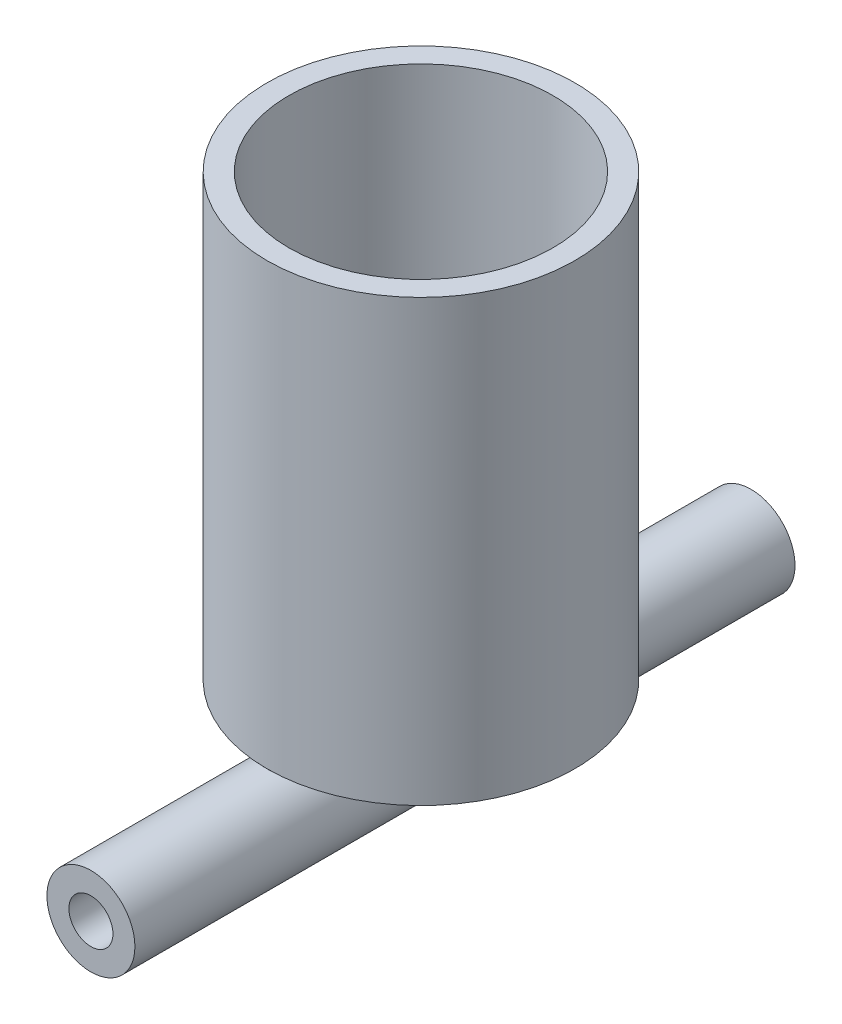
ISO-10303-21;
HEADER;
FILE_DESCRIPTION(('STEP AP214'),'2;1');
FILE_NAME('part.step','',(''),(''),'','','');
FILE_SCHEMA(('AUTOMOTIVE_DESIGN { 1 0 10303 214 1 1 1 1 }'));
ENDSEC;
DATA;
#1=APPLICATION_CONTEXT('core data for automotive mechanical design processes');
#2=APPLICATION_PROTOCOL_DEFINITION('international standard','automotive_design',2000,#1);
#3=PRODUCT_CONTEXT('',#1,'mechanical');
#4=PRODUCT('Part','Part','',(#3));
#5=PRODUCT_RELATED_PRODUCT_CATEGORY('part','',(#4));
#6=PRODUCT_DEFINITION_FORMATION('','',#4);
#7=PRODUCT_DEFINITION_CONTEXT('part definition',#1,'design');
#8=PRODUCT_DEFINITION('design','',#6,#7);
#9=PRODUCT_DEFINITION_SHAPE('','',#8);
#10=(LENGTH_UNIT() NAMED_UNIT(*) SI_UNIT(.MILLI.,.METRE.));
#11=(NAMED_UNIT(*) PLANE_ANGLE_UNIT() SI_UNIT($,.RADIAN.));
#12=(NAMED_UNIT(*) SI_UNIT($,.STERADIAN.) SOLID_ANGLE_UNIT());
#13=UNCERTAINTY_MEASURE_WITH_UNIT(LENGTH_MEASURE(1.E-05),#10,'distance_accuracy_value','');
#14=(GEOMETRIC_REPRESENTATION_CONTEXT(3) GLOBAL_UNCERTAINTY_ASSIGNED_CONTEXT((#13)) GLOBAL_UNIT_ASSIGNED_CONTEXT((#10,
#11,#12)) REPRESENTATION_CONTEXT('',''));
#15=CARTESIAN_POINT('',(0.,0.,0.));
#16=DIRECTION('',(0.,0.,1.));
#17=DIRECTION('',(1.,0.,0.));
#18=AXIS2_PLACEMENT_3D('',#15,#16,#17);
#19=CARTESIAN_POINT('',(0.,0.,0.));
#20=DIRECTION('',(0.,1.,0.));
#21=DIRECTION('',(0.,0.,1.));
#22=AXIS2_PLACEMENT_3D('',#19,#20,#21);
#23=CONICAL_SURFACE('',#22,51.0713596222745,1.01419927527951);
#24=CARTESIAN_POINT('',(0.,0.,0.));
#25=DIRECTION('',(0.,1.,0.));
#26=DIRECTION('',(0.,0.,1.));
#27=AXIS2_PLACEMENT_3D('',#24,#25,#26);
#28=CIRCLE('',#27,51.0713596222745);
#29=CARTESIAN_POINT('',(0.,0.,-51.0713596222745));
#30=VERTEX_POINT('',#29);
#31=CARTESIAN_POINT('',(0.,0.,51.0713596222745));
#32=VERTEX_POINT('',#31);
#33=EDGE_CURVE('E109',#30,#32,#28,.T.);
#34=ORIENTED_EDGE('',*,*,#33,.T.);
#35=CARTESIAN_POINT('',(-7.80420879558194,-1.58548602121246,-47.8915394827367));
#36=CARTESIAN_POINT('',(-8.11266651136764,-1.71621006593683,-47.6284109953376));
#37=CARTESIAN_POINT('',(-8.41076449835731,-1.85167738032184,-47.3554837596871));
#38=CARTESIAN_POINT('',(-8.98762008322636,-2.13032414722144,-46.7934738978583));
#39=CARTESIAN_POINT('',(-9.2663693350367,-2.27350688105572,-46.504384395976));
#40=CARTESIAN_POINT('',(-9.80630146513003,-2.56638463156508,-45.9123408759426));
#41=CARTESIAN_POINT('',(-10.0674511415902,-2.71609112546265,-45.6093623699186));
#42=CARTESIAN_POINT('',(-10.5729370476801,-3.02059941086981,-44.9922751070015));
#43=CARTESIAN_POINT('',(-10.8172753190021,-3.17540058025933,-44.6781677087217));
#44=CARTESIAN_POINT('',(-11.2924284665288,-3.49051769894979,-44.0378370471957));
#45=CARTESIAN_POINT('',(-11.5231115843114,-3.65086920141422,-43.7115338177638));
#46=CARTESIAN_POINT('',(-11.9698594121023,-3.9750622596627,-43.0507761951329));
#47=CARTESIAN_POINT('',(-12.1859238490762,-4.1389038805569,-42.7163216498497));
#48=CARTESIAN_POINT('',(-12.6043080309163,-4.4693073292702,-42.0406930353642));
#49=CARTESIAN_POINT('',(-12.8066387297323,-4.63586685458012,-41.6995246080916));
#50=CARTESIAN_POINT('',(-13.1986812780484,-4.97131604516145,-41.0111235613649));
#51=CARTESIAN_POINT('',(-13.3883921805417,-5.14020588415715,-40.6638904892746));
#52=CARTESIAN_POINT('',(-13.8931686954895,-5.60656433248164,-39.7031115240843));
#53=CARTESIAN_POINT('',(-14.1961706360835,-5.90596192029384,-39.0841388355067));
#54=CARTESIAN_POINT('',(-14.7700109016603,-6.50852871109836,-37.833226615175));
#55=CARTESIAN_POINT('',(-15.040843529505,-6.81169857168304,-37.2012848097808));
#56=CARTESIAN_POINT('',(-15.5535831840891,-7.42047159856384,-35.9262094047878));
#57=CARTESIAN_POINT('',(-15.795465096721,-7.7260766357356,-35.2830666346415));
#58=CARTESIAN_POINT('',(-16.2525563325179,-8.33808574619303,-33.9878376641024));
#59=CARTESIAN_POINT('',(-16.4677671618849,-8.64448977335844,-33.3357519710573));
#60=CARTESIAN_POINT('',(-16.8739349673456,-9.25729990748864,-32.0229343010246));
#61=CARTESIAN_POINT('',(-17.0648586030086,-9.56370545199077,-31.3621917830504));
#62=CARTESIAN_POINT('',(-17.4239247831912,-10.1749071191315,-30.0338216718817));
#63=CARTESIAN_POINT('',(-17.59206711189,-10.4797032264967,-29.3661940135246));
#64=CARTESIAN_POINT('',(-17.90705288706,-11.086293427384,-28.025052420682));
#65=CARTESIAN_POINT('',(-18.0539078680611,-11.3880890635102,-27.3515418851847));
#66=CARTESIAN_POINT('',(-18.3278181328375,-11.9875308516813,-25.9986685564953));
#67=CARTESIAN_POINT('',(-18.4548729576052,-12.285176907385,-25.319305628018));
#68=CARTESIAN_POINT('',(-18.7100624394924,-12.9239353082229,-23.841339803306));
#69=CARTESIAN_POINT('',(-18.8348536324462,-13.264032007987,-23.0417195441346));
#70=CARTESIAN_POINT('',(-19.061108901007,-13.9337797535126,-21.4348252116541));
#71=CARTESIAN_POINT('',(-19.1625723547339,-14.2634305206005,-20.6275509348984));
#72=CARTESIAN_POINT('',(-19.3441352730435,-14.9091289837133,-19.0042712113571));
#73=CARTESIAN_POINT('',(-19.4242138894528,-15.2251631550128,-18.1882580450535));
#74=CARTESIAN_POINT('',(-19.5648665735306,-15.8388643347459,-16.5476807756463));
#75=CARTESIAN_POINT('',(-19.625440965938,-16.136531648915,-15.7231168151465));
#76=CARTESIAN_POINT('',(-19.7287838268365,-16.704907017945,-14.0730160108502));
#77=CARTESIAN_POINT('',(-19.7717272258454,-16.9758585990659,-13.2475744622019));
#78=CARTESIAN_POINT('',(-19.8431919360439,-17.4871584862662,-11.5864760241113));
#79=CARTESIAN_POINT('',(-19.8717119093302,-17.7275039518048,-10.7508181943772));
#80=CARTESIAN_POINT('',(-19.9171922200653,-18.1684604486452,-9.07004276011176));
#81=CARTESIAN_POINT('',(-19.9341703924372,-18.3691324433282,-8.22494181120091));
#82=CARTESIAN_POINT('',(-19.9598494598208,-18.7210256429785,-6.52440716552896));
#83=CARTESIAN_POINT('',(-19.9685530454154,-18.8722629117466,-5.66897691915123));
#84=CARTESIAN_POINT('',(-19.9784013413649,-19.067841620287,-4.28537687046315));
#85=CARTESIAN_POINT('',(-19.9811705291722,-19.1308644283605,-3.75983365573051));
#86=CARTESIAN_POINT('',(-19.9853527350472,-19.2329759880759,-2.70640882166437));
#87=CARTESIAN_POINT('',(-19.9867658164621,-19.2720658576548,-2.17852731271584));
#88=CARTESIAN_POINT('',(-19.9886244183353,-19.3250173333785,-1.12161225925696));
#89=CARTESIAN_POINT('',(-19.9890701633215,-19.3388847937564,-0.592579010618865));
#90=CARTESIAN_POINT('',(-19.9891379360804,-19.340934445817,0.465544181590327));
#91=CARTESIAN_POINT('',(-19.9887599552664,-19.3291163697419,0.994634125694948));
#92=CARTESIAN_POINT('',(-19.9870547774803,-19.2801153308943,2.05348966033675));
#93=CARTESIAN_POINT('',(-19.9857242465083,-19.2428432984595,2.58325108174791));
#94=CARTESIAN_POINT('',(-19.9817372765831,-19.1440790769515,3.64048563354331));
#95=CARTESIAN_POINT('',(-19.9790808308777,-19.0825867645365,4.16795875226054));
#96=CARTESIAN_POINT('',(-19.9718740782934,-18.937210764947,5.22002411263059));
#97=CARTESIAN_POINT('',(-19.9673228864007,-18.8533166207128,5.74461489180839));
#98=CARTESIAN_POINT('',(-19.9556421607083,-18.6653809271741,6.79012461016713));
#99=CARTESIAN_POINT('',(-19.9485125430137,-18.5613387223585,7.31104342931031));
#100=CARTESIAN_POINT('',(-19.9241540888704,-18.2483659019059,8.74924271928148));
#101=CARTESIAN_POINT('',(-19.903377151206,-18.02042934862,9.66234478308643));
#102=CARTESIAN_POINT('',(-19.8473933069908,-17.5212920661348,11.4762300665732));
#103=CARTESIAN_POINT('',(-19.81218226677,-17.250078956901,12.3770096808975));
#104=CARTESIAN_POINT('',(-19.7237549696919,-16.6745883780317,14.1679830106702));
#105=CARTESIAN_POINT('',(-19.6705205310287,-16.3702777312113,15.0581650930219));
#106=CARTESIAN_POINT('',(-19.5430666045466,-15.7370304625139,16.8280462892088));
#107=CARTESIAN_POINT('',(-19.4688493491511,-15.4080964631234,17.7077465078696));
#108=CARTESIAN_POINT('',(-19.2966876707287,-14.7312169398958,19.45923003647));
#109=CARTESIAN_POINT('',(-19.198701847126,-14.3832390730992,20.3309967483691));
#110=CARTESIAN_POINT('',(-18.9766908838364,-13.6735875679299,22.0656372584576));
#111=CARTESIAN_POINT('',(-18.8526646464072,-13.3119133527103,22.9285106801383));
#112=CARTESIAN_POINT('',(-18.5763681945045,-12.5789583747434,24.6447196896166));
#113=CARTESIAN_POINT('',(-18.4241226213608,-12.2076862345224,25.4980629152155));
#114=CARTESIAN_POINT('',(-18.0888936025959,-11.4583110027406,27.1955897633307));
#115=CARTESIAN_POINT('',(-17.9059130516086,-11.080208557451,28.0397742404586));
#116=CARTESIAN_POINT('',(-17.5035990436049,-10.3142413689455,29.7304214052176));
#117=CARTESIAN_POINT('',(-17.2837782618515,-9.92631451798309,30.5767405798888));
#118=CARTESIAN_POINT('',(-16.8063631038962,-9.1485268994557,32.2578982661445));
#119=CARTESIAN_POINT('',(-16.5487661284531,-8.75866600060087,33.0927359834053));
#120=CARTESIAN_POINT('',(-15.9909309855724,-7.97831368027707,34.7512577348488));
#121=CARTESIAN_POINT('',(-15.6905633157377,-7.58782404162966,35.5748992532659));
#122=CARTESIAN_POINT('',(-15.0427618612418,-6.81016971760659,37.205124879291));
#123=CARTESIAN_POINT('',(-14.6953355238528,-6.42300451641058,38.0117116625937));
#124=CARTESIAN_POINT('',(-14.131053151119,-5.84417721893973,39.2115265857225));
#125=CARTESIAN_POINT('',(-13.9340277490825,-5.65002161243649,39.6129322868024));
#126=CARTESIAN_POINT('',(-13.5250942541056,-5.26395736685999,40.4092334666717));
#127=CARTESIAN_POINT('',(-13.31318594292,-5.07204876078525,40.8041288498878));
#128=CARTESIAN_POINT('',(-12.8731256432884,-4.69093608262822,41.5866936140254));
#129=CARTESIAN_POINT('',(-12.6449586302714,-4.50173471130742,41.9743558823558));
#130=CARTESIAN_POINT('',(-12.1712194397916,-4.12698374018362,42.7407229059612));
#131=CARTESIAN_POINT('',(-11.9256478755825,-3.94143401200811,43.1194279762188));
#132=CARTESIAN_POINT('',(-11.4174711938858,-3.57628162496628,43.8634048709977));
#133=CARTESIAN_POINT('',(-11.1550070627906,-3.39664488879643,44.2287559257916));
#134=CARTESIAN_POINT('',(-10.609684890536,-3.04298884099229,44.9469131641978));
#135=CARTESIAN_POINT('',(-10.3268236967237,-2.86897040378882,45.2997173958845));
#136=CARTESIAN_POINT('',(-9.73945131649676,-2.52836196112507,45.9893004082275));
#137=CARTESIAN_POINT('',(-9.43498370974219,-2.36175804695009,46.3261092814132));
#138=CARTESIAN_POINT('',(-8.80202341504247,-2.03751764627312,46.9807845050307));
#139=CARTESIAN_POINT('',(-8.4735432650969,-1.87987655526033,47.2986605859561));
#140=CARTESIAN_POINT('',(-7.90676500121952,-1.62763457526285,47.8067418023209));
#141=CARTESIAN_POINT('',(-7.67582114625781,-1.52983786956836,48.0035794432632));
#142=CARTESIAN_POINT('',(-7.20205099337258,-1.34000025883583,48.3854177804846));
#143=CARTESIAN_POINT('',(-6.95922535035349,-1.24795903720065,48.5704191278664));
#144=CARTESIAN_POINT('',(-6.46109037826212,-1.07054516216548,48.9268069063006));
#145=CARTESIAN_POINT('',(-6.20577146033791,-0.985177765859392,49.0981826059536));
#146=CARTESIAN_POINT('',(-5.68260824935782,-0.822330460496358,49.4249290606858));
#147=CARTESIAN_POINT('',(-5.41476355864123,-0.744850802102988,49.5802993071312));
#148=CARTESIAN_POINT('',(-4.86341909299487,-0.598209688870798,49.8742273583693));
#149=CARTESIAN_POINT('',(-4.57977128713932,-0.529157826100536,50.0125638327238));
#150=CARTESIAN_POINT('',(-4.00047441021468,-0.401936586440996,50.2673398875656));
#151=CARTESIAN_POINT('',(-3.70482866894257,-0.343764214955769,50.3837854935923));
#152=CARTESIAN_POINT('',(-3.10318105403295,-0.239855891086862,50.5917222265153));
#153=CARTESIAN_POINT('',(-2.79719455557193,-0.194102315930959,50.6832487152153));
#154=CARTESIAN_POINT('',(-2.176572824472,-0.116331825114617,50.838791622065));
#155=CARTESIAN_POINT('',(-1.86193886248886,-0.0843129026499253,50.9028120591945));
#156=CARTESIAN_POINT('',(-1.24868818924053,-0.0368145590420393,50.9977728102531));
#157=CARTESIAN_POINT('',(-0.950453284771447,-0.0203512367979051,51.0306810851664));
#158=CARTESIAN_POINT('',(-0.351787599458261,-0.000852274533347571,51.0696565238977));
#159=CARTESIAN_POINT('',(-0.0513569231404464,0.00218400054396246,51.0757249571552));
#160=CARTESIAN_POINT('',(0.548651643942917,-0.00527539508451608,51.0608153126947));
#161=CARTESIAN_POINT('',(0.848229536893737,-0.0157710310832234,51.0398373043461));
#162=CARTESIAN_POINT('',(1.44357551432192,-0.0499375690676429,50.9715375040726));
#163=CARTESIAN_POINT('',(1.73934377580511,-0.0736078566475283,50.9242169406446));
#164=CARTESIAN_POINT('',(2.28006592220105,-0.128825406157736,50.8138038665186));
#165=CARTESIAN_POINT('',(2.52592158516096,-0.158632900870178,50.7541931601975));
#166=CARTESIAN_POINT('',(3.01185273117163,-0.226558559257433,50.6183192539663));
#167=CARTESIAN_POINT('',(3.25192652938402,-0.264679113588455,50.542051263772));
#168=CARTESIAN_POINT('',(3.96176617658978,-0.39043514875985,50.2903786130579));
#169=CARTESIAN_POINT('',(4.42145993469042,-0.489498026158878,50.0920392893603));
#170=CARTESIAN_POINT('',(5.58361708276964,-0.780939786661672,49.5080505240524));
#171=CARTESIAN_POINT('',(6.26088575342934,-0.993183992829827,49.0823333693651));
#172=CARTESIAN_POINT('',(7.21501444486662,-1.34365808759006,48.3780857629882));
#173=CARTESIAN_POINT('',(7.52329093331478,-1.46609882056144,48.1318578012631));
#174=CARTESIAN_POINT('',(8.12045014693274,-1.7198635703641,47.6210472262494));
#175=CARTESIAN_POINT('',(8.40933658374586,-1.85118587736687,47.3564681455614));
#176=CARTESIAN_POINT('',(8.93556920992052,-2.10501312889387,46.8445302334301));
#177=CARTESIAN_POINT('',(9.17496308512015,-2.22671463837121,46.5988547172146));
#178=CARTESIAN_POINT('',(9.64045208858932,-2.47484131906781,46.0974599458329));
#179=CARTESIAN_POINT('',(9.86654540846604,-2.60126712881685,45.8417393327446));
#180=CARTESIAN_POINT('',(10.5263807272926,-2.98661376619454,45.0614445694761));
#181=CARTESIAN_POINT('',(10.9414551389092,-3.25149405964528,44.5239586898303));
#182=CARTESIAN_POINT('',(11.7283870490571,-3.79280453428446,43.4227142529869));
#183=CARTESIAN_POINT('',(12.1001752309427,-4.06925230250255,42.8589155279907));
#184=CARTESIAN_POINT('',(12.8050069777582,-4.6300783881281,41.7117433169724));
#185=CARTESIAN_POINT('',(13.1380597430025,-4.91445480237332,41.1283745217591));
#186=CARTESIAN_POINT('',(13.7782381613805,-5.49647568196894,39.9303374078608));
#187=CARTESIAN_POINT('',(14.0844344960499,-5.79427169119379,39.3152492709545));
#188=CARTESIAN_POINT('',(14.6644736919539,-6.39385534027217,38.0718005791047));
#189=CARTESIAN_POINT('',(14.9383098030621,-6.69564379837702,37.4434372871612));
#190=CARTESIAN_POINT('',(15.4568951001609,-7.30182711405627,36.1753347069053));
#191=CARTESIAN_POINT('',(15.7016183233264,-7.60622404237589,35.5355858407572));
#192=CARTESIAN_POINT('',(16.164258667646,-8.21597863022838,34.247015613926));
#193=CARTESIAN_POINT('',(16.3821775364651,-8.52133622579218,33.598194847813));
#194=CARTESIAN_POINT('',(16.7942963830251,-9.13315906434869,32.2898028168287));
#195=CARTESIAN_POINT('',(16.9883865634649,-9.43962319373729,31.6301965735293));
#196=CARTESIAN_POINT('',(17.35356729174,-10.0511056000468,30.3039957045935));
#197=CARTESIAN_POINT('',(17.5246575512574,-10.3561238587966,29.6374009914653));
#198=CARTESIAN_POINT('',(17.8453454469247,-10.9633277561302,28.2982596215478));
#199=CARTESIAN_POINT('',(17.9949548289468,-11.2655148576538,27.6257164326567));
#200=CARTESIAN_POINT('',(18.2742029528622,-11.8659287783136,26.2747371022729));
#201=CARTESIAN_POINT('',(18.4038412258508,-12.1641555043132,25.5963008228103));
#202=CARTESIAN_POINT('',(18.6626953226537,-12.8000801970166,24.1302989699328));
#203=CARTESIAN_POINT('',(18.7888562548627,-13.1368933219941,23.3418094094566));
#204=CARTESIAN_POINT('',(19.0182074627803,-13.800720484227,21.7573865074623));
#205=CARTESIAN_POINT('',(19.1213971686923,-14.1277342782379,20.9614529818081));
#206=CARTESIAN_POINT('',(19.3066861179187,-14.7690042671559,19.3612078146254));
#207=CARTESIAN_POINT('',(19.3887669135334,-15.0832491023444,18.5568894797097));
#208=CARTESIAN_POINT('',(19.533611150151,-15.6945772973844,16.9400298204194));
#209=CARTESIAN_POINT('',(19.5963749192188,-15.991660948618,16.1274886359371));
#210=CARTESIAN_POINT('',(19.7041610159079,-16.5606626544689,14.5012587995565));
#211=CARTESIAN_POINT('',(19.7493484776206,-16.8327956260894,13.6876566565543));
#212=CARTESIAN_POINT('',(19.8251836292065,-17.3485783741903,12.0506460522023));
#213=CARTESIAN_POINT('',(19.8558300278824,-17.5922256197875,11.2272367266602));
#214=CARTESIAN_POINT('',(19.9052693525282,-18.0425738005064,9.57109955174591));
#215=CARTESIAN_POINT('',(19.9240779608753,-18.2493233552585,8.73838552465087));
#216=CARTESIAN_POINT('',(19.9529580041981,-18.6166692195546,7.06271008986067));
#217=CARTESIAN_POINT('',(19.9630320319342,-18.7772792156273,6.21975179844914));
#218=CARTESIAN_POINT('',(19.9746841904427,-18.9907822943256,4.85565782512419));
#219=CARTESIAN_POINT('',(19.9780435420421,-19.0612539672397,4.33726779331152));
#220=CARTESIAN_POINT('',(19.9832481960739,-19.1794386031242,3.29787796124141));
#221=CARTESIAN_POINT('',(19.9850935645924,-19.2271525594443,2.7768782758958));
#222=CARTESIAN_POINT('',(19.9877194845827,-19.2983248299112,1.73337098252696));
#223=CARTESIAN_POINT('',(19.9885003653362,-19.3217906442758,1.21086389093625));
#224=CARTESIAN_POINT('',(19.9892325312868,-19.3437160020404,0.165315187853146));
#225=CARTESIAN_POINT('',(19.9891838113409,-19.3421753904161,-0.357726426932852));
#226=CARTESIAN_POINT('',(19.9882402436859,-19.3141111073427,-1.40416988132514));
#227=CARTESIAN_POINT('',(19.987343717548,-19.2875378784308,-1.92757037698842));
#228=CARTESIAN_POINT('',(19.9844370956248,-19.21021758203,-2.97256229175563));
#229=CARTESIAN_POINT('',(19.9824269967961,-19.1594704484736,-3.49415370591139));
#230=CARTESIAN_POINT('',(19.9768182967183,-19.0353382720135,-4.53483910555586));
#231=CARTESIAN_POINT('',(19.9732189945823,-18.9619432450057,-5.053931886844));
#232=CARTESIAN_POINT('',(19.9638146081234,-18.7945445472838,-6.08874425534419));
#233=CARTESIAN_POINT('',(19.9580094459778,-18.7005401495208,-6.60446372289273));
#234=CARTESIAN_POINT('',(19.9383222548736,-18.4205520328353,-7.99870801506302));
#235=CARTESIAN_POINT('',(19.9216326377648,-18.2167870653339,-8.87363910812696));
#236=CARTESIAN_POINT('',(19.876184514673,-17.7665289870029,-10.6121441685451));
#237=CARTESIAN_POINT('',(19.8474226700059,-17.5200240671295,-11.4757149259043));
#238=CARTESIAN_POINT('',(19.7745643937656,-16.9937986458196,-13.1929151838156));
#239=CARTESIAN_POINT('',(19.7304522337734,-16.7140442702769,-14.0465335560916));
#240=CARTESIAN_POINT('',(19.6241343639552,-16.1293843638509,-15.7438219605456));
#241=CARTESIAN_POINT('',(19.5619304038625,-15.8244812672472,-16.5874929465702));
#242=CARTESIAN_POINT('',(19.4166899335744,-15.1940289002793,-18.2700199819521));
#243=CARTESIAN_POINT('',(19.3335523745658,-14.8683853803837,-19.1088318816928));
#244=CARTESIAN_POINT('',(19.14443879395,-14.2025617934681,-20.7780919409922));
#245=CARTESIAN_POINT('',(19.0384620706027,-13.862381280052,-21.6085398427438));
#246=CARTESIAN_POINT('',(18.8017208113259,-13.1714874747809,-23.2606958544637));
#247=CARTESIAN_POINT('',(18.670976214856,-12.8207828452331,-24.0824104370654));
#248=CARTESIAN_POINT('',(18.3825844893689,-12.1115816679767,-25.7176591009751));
#249=CARTESIAN_POINT('',(18.2249390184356,-11.7530856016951,-26.5311936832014));
#250=CARTESIAN_POINT('',(17.8335329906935,-10.9322222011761,-28.3705472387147));
#251=CARTESIAN_POINT('',(17.5907405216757,-10.4682010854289,-29.3937265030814));
#252=CARTESIAN_POINT('',(17.0526423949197,-9.53589882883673,-31.4246221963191));
#253=CARTESIAN_POINT('',(16.7573275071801,-9.06761695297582,-32.4323358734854));
#254=CARTESIAN_POINT('',(16.2704151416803,-8.36581402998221,-33.9284536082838));
#255=CARTESIAN_POINT('',(16.1009803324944,-8.13221795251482,-34.4240927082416));
#256=CARTESIAN_POINT('',(15.7463977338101,-7.66562284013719,-35.409988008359));
#257=CARTESIAN_POINT('',(15.5612509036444,-7.43262376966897,-35.9002445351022));
#258=CARTESIAN_POINT('',(15.1741676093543,-6.96788309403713,-36.8745112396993));
#259=CARTESIAN_POINT('',(14.972235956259,-6.73614114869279,-37.3585231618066));
#260=CARTESIAN_POINT('',(14.550243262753,-6.27454206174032,-38.3194552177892));
#261=CARTESIAN_POINT('',(14.3301835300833,-6.04468478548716,-38.7963758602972));
#262=CARTESIAN_POINT('',(13.8157830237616,-5.53330711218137,-39.8543197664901));
#263=CARTESIAN_POINT('',(13.5162150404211,-5.25248552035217,-40.4331588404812));
#264=CARTESIAN_POINT('',(12.8835116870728,-4.69665045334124,-41.5752931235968));
#265=CARTESIAN_POINT('',(12.550371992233,-4.42163773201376,-42.1385863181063));
#266=CARTESIAN_POINT('',(11.84672201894,-3.88006887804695,-43.2448576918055));
#267=CARTESIAN_POINT('',(11.4762459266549,-3.61350529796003,-43.787853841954));
#268=CARTESIAN_POINT('',(10.6927825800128,-3.09183784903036,-44.8480328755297));
#269=CARTESIAN_POINT('',(10.2798162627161,-2.83672842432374,-45.3652282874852));
#270=CARTESIAN_POINT('',(9.57899788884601,-2.44054866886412,-46.1668352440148));
#271=CARTESIAN_POINT('',(9.3065126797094,-2.29439053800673,-46.4621911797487));
#272=CARTESIAN_POINT('',(8.74256331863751,-2.00923912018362,-47.0377978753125));
#273=CARTESIAN_POINT('',(8.45110412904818,-1.87024397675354,-47.3180525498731));
#274=CARTESIAN_POINT('',(7.84795426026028,-1.60112758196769,-47.8601437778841));
#275=CARTESIAN_POINT('',(7.53627876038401,-1.47099981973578,-48.1219938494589));
#276=CARTESIAN_POINT('',(6.89153322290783,-1.22165182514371,-48.6233202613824));
#277=CARTESIAN_POINT('',(6.55847000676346,-1.10242814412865,-48.8628036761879));
#278=CARTESIAN_POINT('',(5.70790705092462,-0.824424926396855,-49.4208215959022));
#279=CARTESIAN_POINT('',(5.17716130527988,-0.67331475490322,-49.7237610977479));
#280=CARTESIAN_POINT('',(4.34666354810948,-0.475975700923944,-50.1190857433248));
#281=CARTESIAN_POINT('',(4.06419347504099,-0.415097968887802,-50.2409847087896));
#282=CARTESIAN_POINT('',(3.48848569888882,-0.304410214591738,-50.4625511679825));
#283=CARTESIAN_POINT('',(3.19525017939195,-0.254597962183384,-50.5622231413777));
#284=CARTESIAN_POINT('',(2.65056323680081,-0.174843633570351,-50.7217703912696));
#285=CARTESIAN_POINT('',(2.40053096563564,-0.142960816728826,-50.7855353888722));
#286=CARTESIAN_POINT('',(1.89550180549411,-0.0884070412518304,-50.894626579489));
#287=CARTESIAN_POINT('',(1.64050593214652,-0.0657342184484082,-50.9399565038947));
#288=CARTESIAN_POINT('',(1.1272775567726,-0.0301384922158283,-51.011117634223));
#289=CARTESIAN_POINT('',(0.869047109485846,-0.017209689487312,-51.0369606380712));
#290=CARTESIAN_POINT('',(0.351039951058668,-0.001402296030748,-51.0685570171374));
#291=CARTESIAN_POINT('',(0.0912632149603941,0.00147613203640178,-51.0743100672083));
#292=CARTESIAN_POINT('',(-0.428015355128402,-0.00289368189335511,-51.0655758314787));
#293=CARTESIAN_POINT('',(-0.687516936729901,-0.0101478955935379,-51.0510766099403));
#294=CARTESIAN_POINT('',(-1.20414817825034,-0.0346071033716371,-51.002184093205));
#295=CARTESIAN_POINT('',(-1.46127786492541,-0.0518119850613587,-50.9677910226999));
#296=CARTESIAN_POINT('',(-1.97164494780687,-0.0957722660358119,-50.8798986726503));
#297=CARTESIAN_POINT('',(-2.22487860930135,-0.122536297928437,-50.8263821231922));
#298=CARTESIAN_POINT('',(-2.72577902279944,-0.185008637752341,-50.7014366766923));
#299=CARTESIAN_POINT('',(-2.97344444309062,-0.220719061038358,-50.6300035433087));
#300=CARTESIAN_POINT('',(-3.5329978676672,-0.311935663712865,-50.4474886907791));
#301=CARTESIAN_POINT('',(-3.84265998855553,-0.370179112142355,-50.3309169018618));
#302=CARTESIAN_POINT('',(-4.4491211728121,-0.498677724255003,-50.0736168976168));
#303=CARTESIAN_POINT('',(-4.74591536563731,-0.568937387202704,-49.9328796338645));
#304=CARTESIAN_POINT('',(-5.615963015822,-0.795313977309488,-49.4791832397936));
#305=CARTESIAN_POINT('',(-6.16905190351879,-0.967057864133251,-49.1346808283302));
#306=CARTESIAN_POINT('',(-6.88645805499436,-1.22186116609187,-48.6228480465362));
#307=CARTESIAN_POINT('',(-7.07514232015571,-1.29219699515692,-48.4814965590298));
#308=CARTESIAN_POINT('',(-7.44509341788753,-1.43632926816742,-48.1916868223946));
#309=CARTESIAN_POINT('',(-7.62637284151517,-1.51011933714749,-48.0432416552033));
#310=CARTESIAN_POINT('',(-7.80420879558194,-1.58548602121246,-47.8915394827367));
#311=B_SPLINE_CURVE_WITH_KNOTS('',3,(#35,#36,#37,#38,#39,#40,#41,#42,#43,#44,#45,#46,#47,#48,
#49,#50,#51,#52,#53,#54,#55,#56,#57,#58,#59,#60,#61,#62,#63,#64,#65,#66,#67,#68,#69,#70,#71,#72,
#73,#74,#75,#76,#77,#78,#79,#80,#81,#82,#83,#84,#85,#86,#87,#88,#89,#90,#91,#92,#93,#94,#95,#96,
#97,#98,#99,#100,#101,#102,#103,#104,#105,#106,#107,#108,#109,#110,#111,#112,#113,#114,#115,
#116,#117,#118,#119,#120,#121,#122,#123,#124,#125,#126,#127,#128,#129,#130,#131,#132,#133,#134,
#135,#136,#137,#138,#139,#140,#141,#142,#143,#144,#145,#146,#147,#148,#149,#150,#151,#152,#153,
#154,#155,#156,#157,#158,#159,#160,#161,#162,#163,#164,#165,#166,#167,#168,#169,#170,#171,#172,
#173,#174,#175,#176,#177,#178,#179,#180,#181,#182,#183,#184,#185,#186,#187,#188,#189,#190,#191,
#192,#193,#194,#195,#196,#197,#198,#199,#200,#201,#202,#203,#204,#205,#206,#207,#208,#209,#210,
#211,#212,#213,#214,#215,#216,#217,#218,#219,#220,#221,#222,#223,#224,#225,#226,#227,#228,#229,
#230,#231,#232,#233,#234,#235,#236,#237,#238,#239,#240,#241,#242,#243,#244,#245,#246,#247,#248,
#249,#250,#251,#252,#253,#254,#255,#256,#257,#258,#259,#260,#261,#262,#263,#264,#265,#266,#267,
#268,#269,#270,#271,#272,#273,#274,#275,#276,#277,#278,#279,#280,#281,#282,#283,#284,#285,#286,
#287,#288,#289,#290,#291,#292,#293,#294,#295,#296,#297,#298,#299,#300,#301,#302,#303,#304,#305,
#306,#307,#308,#309,#310),.UNSPECIFIED.,.T.,.F.,(4,2,2,2,2,2,2,2,2,2,2,2,2,2,2,2,2,2,2,2,2,2,2,
2,2,2,2,2,2,2,2,2,2,2,2,2,2,2,2,2,2,2,2,2,2,2,2,2,2,2,2,2,2,2,2,2,2,2,2,2,2,2,2,2,2,2,2,2,2,2,2,
2,2,2,2,2,2,2,2,2,2,2,2,2,2,2,2,2,2,2,2,2,2,2,2,2,2,2,2,2,2,2,2,2,2,2,2,2,2,2,2,2,2,2,2,2,2,2,2,
2,2,2,2,2,2,2,2,2,2,2,2,2,2,2,2,2,2,4),(0.,1.27780770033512,2.55616320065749,3.8368664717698,
5.1174139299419,6.40878486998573,7.70017992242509,8.99053255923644,10.2809819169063,
12.5341157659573,14.7876480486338,17.0431212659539,19.2984670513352,21.556876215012,
23.8153067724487,26.0725089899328,28.3297635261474,30.9629062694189,33.5961191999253,
36.2318899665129,38.8676168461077,41.4765209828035,44.0856670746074,46.6907721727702,
49.2950298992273,50.8825006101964,52.4698971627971,54.0569252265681,55.6439698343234,
57.2365965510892,58.8292313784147,60.4226109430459,62.0160423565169,64.8384702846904,
67.6617070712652,70.4878004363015,73.3135932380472,76.1443438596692,78.9752138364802,
81.8036234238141,84.6317667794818,87.5007979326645,90.370026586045,93.2481351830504,
96.1257888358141,97.5880208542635,99.0502743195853,100.51389702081,101.977468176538,
103.430103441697,104.882963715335,106.332972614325,107.78222973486,108.738262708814,
109.694243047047,110.650968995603,111.607725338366,112.575832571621,113.543672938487,
114.510132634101,115.476451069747,116.376482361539,117.27647108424,118.176457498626,
119.076401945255,119.839818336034,120.603454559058,122.129781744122,124.597773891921,
125.836510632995,127.075009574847,128.166511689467,129.25816186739,131.442456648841,
133.630202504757,135.817427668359,138.063033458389,140.309106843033,142.557168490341,
144.805083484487,147.062995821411,149.320936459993,151.57763770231,153.834391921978,
156.43391868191,159.033509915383,161.635365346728,164.237176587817,166.813915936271,
169.390884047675,171.964431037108,174.537213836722,176.106285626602,177.675288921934,
179.243806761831,180.812334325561,182.383973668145,183.955617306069,185.527954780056,
187.100347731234,189.794270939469,192.488939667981,195.186377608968,197.883554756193,
200.594009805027,203.304548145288,206.01291356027,208.721112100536,212.168198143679,
215.615890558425,217.336275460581,219.056555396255,220.776343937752,222.496008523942,
224.624195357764,226.752656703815,228.879186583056,231.004673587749,232.286866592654,
233.568725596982,234.84963302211,236.130133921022,238.011127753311,238.951045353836,
239.890773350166,240.669972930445,241.449014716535,242.22758446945,243.006166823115,
243.785208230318,244.56424083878,245.343978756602,246.123901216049,247.130214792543,
248.136905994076,250.149747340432,250.887757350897,251.624455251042),.UNSPECIFIED.);
#312=EDGE_CURVE('E64',#30,#32,#311,.T.);
#313=ORIENTED_EDGE('',*,*,#312,.F.);
#314=EDGE_LOOP('',(#34,#313));
#315=FACE_BOUND('',#314,.T.);
#316=ADVANCED_FACE('F40',(#315),#23,.F.);
#317=EDGE_CURVE('E61',#32,#30,#311,.T.);
#318=ORIENTED_EDGE('',*,*,#317,.F.);
#319=EDGE_CURVE('E115',#32,#30,#28,.T.);
#320=ORIENTED_EDGE('',*,*,#319,.T.);
#321=EDGE_LOOP('',(#318,#320));
#322=FACE_BOUND('',#321,.T.);
#323=ADVANCED_FACE('F204',(#322),#23,.F.);
#324=CARTESIAN_POINT('',(0.,-36.9389354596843,0.));
#325=DIRECTION('',(0.,1.,0.));
#326=DIRECTION('',(0.,0.,1.));
#327=AXIS2_PLACEMENT_3D('',#324,#325,#326);
#328=CONICAL_SURFACE('',#327,10.6335537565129,1.01419927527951);
#329=CARTESIAN_POINT('',(-3.10063604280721,-0.241810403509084,-69.542285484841));
#330=CARTESIAN_POINT('',(-2.80376715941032,-0.195222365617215,-69.6304703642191));
#331=CARTESIAN_POINT('',(-2.50245609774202,-0.154804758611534,-69.7069754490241));
#332=CARTESIAN_POINT('',(-1.89298652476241,-0.0874276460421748,-69.8345112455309));
#333=CARTESIAN_POINT('',(-1.58482875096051,-0.0604666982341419,-69.885544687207));
#334=CARTESIAN_POINT('',(-0.964605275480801,-0.0208611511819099,-69.960512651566));
#335=CARTESIAN_POINT('',(-0.652543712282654,-0.00820250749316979,-69.9844737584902));
#336=CARTESIAN_POINT('',(-0.0272637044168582,0.00242536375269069,-70.0045908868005));
#337=CARTESIAN_POINT('',(0.285954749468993,0.000394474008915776,-70.0007466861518));
#338=CARTESIAN_POINT('',(0.910146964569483,-0.0182817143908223,-69.9653951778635));
#339=CARTESIAN_POINT('',(1.22112217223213,-0.0349165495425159,-69.9339076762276));
#340=CARTESIAN_POINT('',(1.83809758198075,-0.0822403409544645,-69.8443301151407));
#341=CARTESIAN_POINT('',(2.14409771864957,-0.112929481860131,-69.7862397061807));
#342=CARTESIAN_POINT('',(2.74897356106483,-0.187475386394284,-69.6451343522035));
#343=CARTESIAN_POINT('',(3.0478409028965,-0.231346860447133,-69.5620915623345));
#344=CARTESIAN_POINT('',(3.6363793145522,-0.331092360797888,-69.3732867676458));
#345=CARTESIAN_POINT('',(3.92604469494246,-0.386973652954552,-69.267511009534));
#346=CARTESIAN_POINT('',(4.55882490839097,-0.523241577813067,-69.009574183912));
#347=CARTESIAN_POINT('',(4.8992885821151,-0.60631281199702,-68.8523315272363));
#348=CARTESIAN_POINT('',(5.56316592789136,-0.786213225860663,-68.5118042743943));
#349=CARTESIAN_POINT('',(5.88657160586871,-0.883048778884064,-68.3285076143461));
#350=CARTESIAN_POINT('',(6.51632154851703,-1.08843242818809,-67.9397440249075));
#351=CARTESIAN_POINT('',(6.82264566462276,-1.19699393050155,-67.7342517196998));
#352=CARTESIAN_POINT('',(7.41811468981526,-1.42385754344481,-67.3048294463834));
#353=CARTESIAN_POINT('',(7.7072610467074,-1.54215883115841,-67.0809010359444));
#354=CARTESIAN_POINT('',(8.45765220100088,-1.86907184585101,-66.4620987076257));
#355=CARTESIAN_POINT('',(8.90425197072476,-2.08503758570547,-66.0533046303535));
#356=CARTESIAN_POINT('',(9.75587541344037,-2.53418166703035,-65.2031353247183));
#357=CARTESIAN_POINT('',(10.1608698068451,-2.7673719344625,-64.761737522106));
#358=CARTESIAN_POINT('',(10.9342106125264,-3.2473726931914,-63.8531606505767));
#359=CARTESIAN_POINT('',(11.3024747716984,-3.49421191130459,-63.3859272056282));
#360=CARTESIAN_POINT('',(12.0051808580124,-3.99804764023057,-62.4322339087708));
#361=CARTESIAN_POINT('',(12.3396285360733,-4.2550424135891,-61.9457773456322));
#362=CARTESIAN_POINT('',(12.9734377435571,-4.77321700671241,-60.9649424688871));
#363=CARTESIAN_POINT('',(13.2732459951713,-5.03427826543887,-60.4707885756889));
#364=CARTESIAN_POINT('',(13.8462088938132,-5.56274286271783,-59.4704760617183));
#365=CARTESIAN_POINT('',(14.1193582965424,-5.83014743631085,-58.9643151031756));
#366=CARTESIAN_POINT('',(14.6414562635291,-6.37029238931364,-57.9418931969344));
#367=CARTESIAN_POINT('',(14.8903858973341,-6.64303674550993,-57.4256247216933));
#368=CARTESIAN_POINT('',(15.3657427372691,-7.19273805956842,-56.3851138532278));
#369=CARTESIAN_POINT('',(15.5921712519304,-7.46969477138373,-55.8608719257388));
#370=CARTESIAN_POINT('',(16.0244911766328,-8.02751646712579,-54.804990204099));
#371=CARTESIAN_POINT('',(16.2303530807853,-8.308386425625,-54.2733409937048));
#372=CARTESIAN_POINT('',(16.6225661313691,-8.87307507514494,-53.2044609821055));
#373=CARTESIAN_POINT('',(16.8089172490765,-9.15689377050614,-52.6672301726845));
#374=CARTESIAN_POINT('',(17.1632276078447,-9.72691874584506,-51.5882491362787));
#375=CARTESIAN_POINT('',(17.331192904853,-10.0131242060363,-51.0465004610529));
#376=CARTESIAN_POINT('',(17.6497952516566,-10.5876369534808,-49.9590245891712));
#377=CARTESIAN_POINT('',(17.8004314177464,-10.8759443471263,-49.4132971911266));
#378=CARTESIAN_POINT('',(18.2054703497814,-11.6985171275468,-47.8562766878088));
#379=CARTESIAN_POINT('',(18.4401035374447,-12.234927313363,-46.8409237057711));
#380=CARTESIAN_POINT('',(18.8575272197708,-13.3121581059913,-44.8018691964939));
#381=CARTESIAN_POINT('',(19.040309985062,-13.8529793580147,-43.7781664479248));
#382=CARTESIAN_POINT('',(19.357100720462,-14.9381468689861,-41.7240883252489));
#383=CARTESIAN_POINT('',(19.491070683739,-15.482495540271,-40.6937083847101));
#384=CARTESIAN_POINT('',(19.7120983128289,-16.5732272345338,-38.6290974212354));
#385=CARTESIAN_POINT('',(19.7991582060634,-17.1196101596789,-37.5948665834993));
#386=CARTESIAN_POINT('',(19.9279604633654,-18.2160518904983,-35.5194465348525));
#387=CARTESIAN_POINT('',(19.9694928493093,-18.766116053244,-34.4782471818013));
#388=CARTESIAN_POINT('',(20.007131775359,-19.8665933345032,-32.3951874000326));
#389=CARTESIAN_POINT('',(20.0032373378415,-20.4170064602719,-31.3533269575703));
#390=CARTESIAN_POINT('',(19.9499803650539,-21.5170037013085,-29.2711745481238));
#391=CARTESIAN_POINT('',(19.9006466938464,-22.0665881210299,-28.2308820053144));
#392=CARTESIAN_POINT('',(19.7558350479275,-23.1644209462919,-26.152824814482));
#393=CARTESIAN_POINT('',(19.6603587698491,-23.7126694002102,-25.1150600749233));
#394=CARTESIAN_POINT('',(19.4388743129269,-24.7286811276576,-23.1918774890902));
#395=CARTESIAN_POINT('',(19.3191820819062,-25.1967459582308,-22.3058890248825));
#396=CARTESIAN_POINT('',(19.0434614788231,-26.1305475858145,-20.5383172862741));
#397=CARTESIAN_POINT('',(18.8874331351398,-26.596284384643,-19.6567340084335));
#398=CARTESIAN_POINT('',(18.5369630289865,-27.525138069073,-17.8985244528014));
#399=CARTESIAN_POINT('',(18.3424789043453,-27.9882514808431,-17.0219047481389));
#400=CARTESIAN_POINT('',(17.912698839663,-28.9103309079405,-15.2765125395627));
#401=CARTESIAN_POINT('',(17.6774046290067,-29.3692970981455,-14.4077397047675));
#402=CARTESIAN_POINT('',(17.1650811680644,-30.2776162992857,-12.6883852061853));
#403=CARTESIAN_POINT('',(16.8884563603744,-30.7270189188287,-11.837709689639));
#404=CARTESIAN_POINT('',(16.2876603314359,-31.6190161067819,-10.1492361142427));
#405=CARTESIAN_POINT('',(15.9634794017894,-32.0616092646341,-9.31144072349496));
#406=CARTESIAN_POINT('',(15.4379155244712,-32.7180553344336,-8.06882265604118));
#407=CARTESIAN_POINT('',(15.256390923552,-32.9354047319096,-7.65738905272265));
#408=CARTESIAN_POINT('',(14.8793216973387,-33.3674244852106,-6.83958509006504));
#409=CARTESIAN_POINT('',(14.6837780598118,-33.5820950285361,-6.43321437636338));
#410=CARTESIAN_POINT('',(14.2778275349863,-34.0082185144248,-5.62655006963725));
#411=CARTESIAN_POINT('',(14.0674280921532,-34.2196730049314,-5.22625355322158));
#412=CARTESIAN_POINT('',(13.6306192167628,-34.6389162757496,-4.43257578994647));
#413=CARTESIAN_POINT('',(13.4042118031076,-34.846705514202,-4.03919367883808));
#414=CARTESIAN_POINT('',(13.0098279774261,-35.1917471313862,-3.38592022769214));
#415=CARTESIAN_POINT('',(12.8465093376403,-35.3301696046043,-3.1238291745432));
#416=CARTESIAN_POINT('',(12.5115127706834,-35.6047736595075,-2.60384282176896));
#417=CARTESIAN_POINT('',(12.3398349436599,-35.7409552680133,-2.34594747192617));
#418=CARTESIAN_POINT('',(11.9877588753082,-36.0107089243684,-1.83496371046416));
#419=CARTESIAN_POINT('',(11.8073643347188,-36.1442820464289,-1.58187332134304));
#420=CARTESIAN_POINT('',(11.437378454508,-36.4084740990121,-1.08095215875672));
#421=CARTESIAN_POINT('',(11.2477874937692,-36.5390931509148,-0.833121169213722));
#422=CARTESIAN_POINT('',(10.9802517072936,-36.7165129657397,-0.494550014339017));
#423=CARTESIAN_POINT('',(10.9060389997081,-36.7650242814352,-0.401769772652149));
#424=CARTESIAN_POINT('',(10.8019956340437,-36.8320580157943,-0.270614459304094));
#425=CARTESIAN_POINT('',(10.7720075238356,-36.8512643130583,-0.232685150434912));
#426=CARTESIAN_POINT('',(10.721956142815,-36.8831344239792,-0.167667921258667));
#427=CARTESIAN_POINT('',(10.7016908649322,-36.8959851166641,-0.140853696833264));
#428=CARTESIAN_POINT('',(10.6753248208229,-36.9126437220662,-0.102170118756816));
#429=CARTESIAN_POINT('',(10.6682031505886,-36.9171365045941,-0.0912940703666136));
#430=CARTESIAN_POINT('',(10.6548013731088,-36.9255802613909,-0.0688043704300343));
#431=CARTESIAN_POINT('',(10.6485186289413,-36.9295329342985,-0.0571932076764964));
#432=CARTESIAN_POINT('',(10.6413082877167,-36.9340652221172,-0.0396617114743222));
#433=CARTESIAN_POINT('',(10.6393864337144,-36.9352726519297,-0.0343394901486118));
#434=CARTESIAN_POINT('',(10.6362570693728,-36.937238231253,-0.0234178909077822));
#435=CARTESIAN_POINT('',(10.6350463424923,-36.9379984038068,-0.0178198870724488));
#436=CARTESIAN_POINT('',(10.6337294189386,-36.9388252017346,-0.00741120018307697));
#437=CARTESIAN_POINT('',(10.633470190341,-36.938987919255,-0.00262886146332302));
#438=CARTESIAN_POINT('',(10.6336857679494,-36.9388525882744,0.0069112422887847));
#439=CARTESIAN_POINT('',(10.6341606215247,-36.9385545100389,0.0116690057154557));
#440=CARTESIAN_POINT('',(10.6360273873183,-36.9373824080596,0.022723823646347));
#441=CARTESIAN_POINT('',(10.6376890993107,-36.9363389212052,0.0289544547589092));
#442=CARTESIAN_POINT('',(10.6417901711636,-36.9337623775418,0.0410643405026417));
#443=CARTESIAN_POINT('',(10.6442342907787,-36.9322263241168,0.0469411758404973));
#444=CARTESIAN_POINT('',(10.6569767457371,-36.924212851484,0.0746333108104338));
#445=CARTESIAN_POINT('',(10.6699614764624,-36.9160323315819,0.0945850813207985));
#446=CARTESIAN_POINT('',(10.6968740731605,-36.8990284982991,0.133492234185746));
#447=CARTESIAN_POINT('',(10.7108076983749,-36.890201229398,0.152440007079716));
#448=CARTESIAN_POINT('',(10.7802509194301,-36.8460799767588,0.245054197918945));
#449=CARTESIAN_POINT('',(10.837961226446,-36.8090185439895,0.316384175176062));
#450=CARTESIAN_POINT('',(10.9525772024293,-36.7345715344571,0.459499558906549));
#451=CARTESIAN_POINT('',(11.0094818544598,-36.6971856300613,0.531285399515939));
#452=CARTESIAN_POINT('',(11.1792046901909,-36.5844404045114,0.746913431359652));
#453=CARTESIAN_POINT('',(11.2911399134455,-36.5084248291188,0.891159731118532));
#454=CARTESIAN_POINT('',(11.5117032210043,-36.3553903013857,1.18152102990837));
#455=CARTESIAN_POINT('',(11.6203322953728,-36.2783716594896,1.32763545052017));
#456=CARTESIAN_POINT('',(11.8347444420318,-36.1231618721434,1.62189611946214));
#457=CARTESIAN_POINT('',(11.9405209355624,-36.0449685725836,1.77004604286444));
#458=CARTESIAN_POINT('',(12.1490230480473,-35.8876772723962,2.06802061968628));
#459=CARTESIAN_POINT('',(12.251748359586,-35.8085791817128,2.21784543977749));
#460=CARTESIAN_POINT('',(12.760235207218,-35.409242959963,2.97418037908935));
#461=CARTESIAN_POINT('',(13.1436381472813,-35.0826392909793,3.59252521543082));
#462=CARTESIAN_POINT('',(13.8681503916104,-34.4192806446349,4.84837710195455));
#463=CARTESIAN_POINT('',(14.2092401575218,-34.0825210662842,5.48589283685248));
#464=CARTESIAN_POINT('',(14.8539971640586,-33.4007144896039,6.77657307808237));
#465=CARTESIAN_POINT('',(15.1576105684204,-33.055656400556,7.42975852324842));
#466=CARTESIAN_POINT('',(15.7304601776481,-32.3594392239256,8.7476655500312));
#467=CARTESIAN_POINT('',(15.9996992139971,-32.0082806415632,9.41238617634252));
#468=CARTESIAN_POINT('',(16.5873868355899,-31.1887241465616,10.9637440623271));
#469=CARTESIAN_POINT('',(16.8942984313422,-30.7185191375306,11.8537988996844));
#470=CARTESIAN_POINT('',(17.4590523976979,-29.7716562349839,13.6461164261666));
#471=CARTESIAN_POINT('',(17.7168827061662,-29.2949967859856,14.5483820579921));
#472=CARTESIAN_POINT('',(18.1876360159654,-28.3363824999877,16.3629327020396));
#473=CARTESIAN_POINT('',(18.4005137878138,-27.8544228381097,17.2752268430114));
#474=CARTESIAN_POINT('',(18.7840675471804,-26.8869105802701,19.10661354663));
#475=CARTESIAN_POINT('',(18.9547467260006,-26.4013582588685,20.0257055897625));
#476=CARTESIAN_POINT('',(19.2567511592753,-25.4257898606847,21.8723372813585));
#477=CARTESIAN_POINT('',(19.3879302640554,-24.9357639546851,22.7998955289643));
#478=CARTESIAN_POINT('',(19.6117584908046,-23.9537960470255,24.6586377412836));
#479=CARTESIAN_POINT('',(19.7044069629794,-23.4618540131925,25.5898217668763));
#480=CARTESIAN_POINT('',(19.8522594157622,-22.4770133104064,27.4539997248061));
#481=CARTESIAN_POINT('',(19.9074834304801,-21.9841152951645,28.3869924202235));
#482=CARTESIAN_POINT('',(19.9812196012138,-20.9977248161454,30.2541023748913));
#483=CARTESIAN_POINT('',(19.9997318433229,-20.504232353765,31.1882196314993));
#484=CARTESIAN_POINT('',(20.0002726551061,-19.4981499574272,33.0926026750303));
#485=CARTESIAN_POINT('',(19.9808622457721,-18.9855597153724,34.0628690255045));
#486=CARTESIAN_POINT('',(19.902426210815,-17.9610320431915,36.002165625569));
#487=CARTESIAN_POINT('',(19.8434000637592,-17.449094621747,36.9711958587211));
#488=CARTESIAN_POINT('',(19.6849265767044,-16.4262508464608,38.9073043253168));
#489=CARTESIAN_POINT('',(19.5854534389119,-15.9153453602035,39.8743809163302));
#490=CARTESIAN_POINT('',(19.3447766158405,-14.8956836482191,41.8044655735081));
#491=CARTESIAN_POINT('',(19.2035737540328,-14.3869273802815,42.7674737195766));
#492=CARTESIAN_POINT('',(18.8775921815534,-13.3727784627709,44.6871229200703));
#493=CARTESIAN_POINT('',(18.6928409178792,-12.8673838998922,45.6437675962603));
#494=CARTESIAN_POINT('',(18.2769976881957,-11.8607127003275,47.549262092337));
#495=CARTESIAN_POINT('',(18.0459018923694,-11.3594364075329,48.4981112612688));
#496=CARTESIAN_POINT('',(17.534012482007,-10.3629900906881,50.3842511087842));
#497=CARTESIAN_POINT('',(17.2532761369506,-9.86781372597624,51.3215537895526));
#498=CARTESIAN_POINT('',(16.7911627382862,-9.13074242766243,52.7167311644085));
#499=CARTESIAN_POINT('',(16.6303017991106,-8.8860164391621,53.1799647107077));
#500=CARTESIAN_POINT('',(16.294126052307,-8.39874526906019,54.1023038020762));
#501=CARTESIAN_POINT('',(16.1188120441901,-8.15619996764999,54.5614095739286));
#502=CARTESIAN_POINT('',(15.753797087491,-7.67487805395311,55.4724874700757));
#503=CARTESIAN_POINT('',(15.5641744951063,-7.43608849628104,55.9244840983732));
#504=CARTESIAN_POINT('',(15.1687785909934,-6.96145860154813,56.8228948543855));
#505=CARTESIAN_POINT('',(14.9630065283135,-6.72561803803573,57.2693094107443));
#506=CARTESIAN_POINT('',(14.5339954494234,-6.25722307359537,58.1559182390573));
#507=CARTESIAN_POINT('',(14.3107442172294,-6.02467110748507,58.5961079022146));
#508=CARTESIAN_POINT('',(13.8455638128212,-5.56367075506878,59.4687196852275));
#509=CARTESIAN_POINT('',(13.6036349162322,-5.33522230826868,59.9011419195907));
#510=CARTESIAN_POINT('',(13.101376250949,-4.88487869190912,60.753581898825));
#511=CARTESIAN_POINT('',(12.8411932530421,-4.66294792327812,61.1736670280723));
#512=CARTESIAN_POINT('',(12.2990880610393,-4.22489600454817,62.0028404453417));
#513=CARTESIAN_POINT('',(12.0171632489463,-4.00877555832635,62.4119274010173));
#514=CARTESIAN_POINT('',(11.4300321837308,-3.58398718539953,63.2159946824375));
#515=CARTESIAN_POINT('',(11.1248620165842,-3.37530841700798,63.610995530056));
#516=CARTESIAN_POINT('',(10.4886843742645,-2.96678593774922,64.3842736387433));
#517=CARTESIAN_POINT('',(10.1576876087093,-2.76693861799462,64.762557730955));
#518=CARTESIAN_POINT('',(9.58406168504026,-2.44396323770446,65.3739066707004));
#519=CARTESIAN_POINT('',(9.34939688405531,-2.31774327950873,65.6128240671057));
#520=CARTESIAN_POINT('',(8.86687596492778,-2.07091858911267,66.0800299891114));
#521=CARTESIAN_POINT('',(8.61902064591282,-1.95031351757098,66.3083191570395));
#522=CARTESIAN_POINT('',(8.10906913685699,-1.71552882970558,66.7527349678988));
#523=CARTESIAN_POINT('',(7.84695541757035,-1.60135749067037,66.9688459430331));
#524=CARTESIAN_POINT('',(7.30812080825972,-1.38075947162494,67.3864082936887));
#525=CARTESIAN_POINT('',(7.03139959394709,-1.27433296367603,67.5878593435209));
#526=CARTESIAN_POINT('',(6.45981122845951,-1.0694956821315,67.9755887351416));
#527=CARTESIAN_POINT('',(6.16477976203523,-0.971184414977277,68.1616787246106));
#528=CARTESIAN_POINT('',(5.55917710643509,-0.785530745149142,68.5130961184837));
#529=CARTESIAN_POINT('',(5.24860484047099,-0.698189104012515,68.6784220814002));
#530=CARTESIAN_POINT('',(4.6130022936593,-0.536508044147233,68.9844625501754));
#531=CARTESIAN_POINT('',(4.28800100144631,-0.462143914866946,69.1252238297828));
#532=CARTESIAN_POINT('',(3.62430363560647,-0.328221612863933,69.3787207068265));
#533=CARTESIAN_POINT('',(3.28561300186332,-0.26865762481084,69.4914673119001));
#534=CARTESIAN_POINT('',(2.6836402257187,-0.179153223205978,69.6608870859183));
#535=CARTESIAN_POINT('',(2.42285366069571,-0.14553018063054,69.7245309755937));
#536=CARTESIAN_POINT('',(1.8962929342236,-0.0883413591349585,69.8327817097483));
#537=CARTESIAN_POINT('',(1.63051992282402,-0.0647732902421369,69.8773928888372));
#538=CARTESIAN_POINT('',(1.09579613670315,-0.0282448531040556,69.9465362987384));
#539=CARTESIAN_POINT('',(0.826847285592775,-0.0152783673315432,69.9710801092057));
#540=CARTESIAN_POINT('',(0.287540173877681,-0.000247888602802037,69.9995307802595));
#541=CARTESIAN_POINT('',(0.0171818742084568,0.00181580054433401,70.0034370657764));
#542=CARTESIAN_POINT('',(-0.523026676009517,-0.00501441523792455,69.9905083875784));
#543=CARTESIAN_POINT('',(-0.792876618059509,-0.0139136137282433,69.9736634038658));
#544=CARTESIAN_POINT('',(-1.32993833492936,-0.042455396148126,69.9196376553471));
#545=CARTESIAN_POINT('',(-1.597150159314,-0.0620977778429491,69.8824572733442));
#546=CARTESIAN_POINT('',(-2.12730799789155,-0.111674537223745,69.7886151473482));
#547=CARTESIAN_POINT('',(-2.39025136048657,-0.141615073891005,69.7319417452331));
#548=CARTESIAN_POINT('',(-2.91025213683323,-0.211132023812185,69.6003555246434));
#549=CARTESIAN_POINT('',(-3.16730815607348,-0.250710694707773,69.5254384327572));
#550=CARTESIAN_POINT('',(-3.75056751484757,-0.35196776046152,69.33377244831));
#551=CARTESIAN_POINT('',(-4.07434175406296,-0.416713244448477,69.2112179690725));
#552=CARTESIAN_POINT('',(-4.70823320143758,-0.559366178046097,68.9411951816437));
#553=CARTESIAN_POINT('',(-5.01834634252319,-0.637277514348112,68.7937195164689));
#554=CARTESIAN_POINT('',(-5.92783830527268,-0.88831372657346,68.3185417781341));
#555=CARTESIAN_POINT('',(-6.5057164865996,-1.07862110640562,67.9583155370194));
#556=CARTESIAN_POINT('',(-7.49048656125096,-1.44978413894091,67.2557538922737));
#557=CARTESIAN_POINT('',(-7.90817400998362,-1.62460964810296,66.9248327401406));
#558=CARTESIAN_POINT('',(-8.7096329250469,-1.99066151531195,66.2319458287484));
#559=CARTESIAN_POINT('',(-9.09338289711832,-2.18189811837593,65.8699606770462));
#560=CARTESIAN_POINT('',(-9.82994299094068,-2.57739050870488,65.1213468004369));
#561=CARTESIAN_POINT('',(-10.1827008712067,-2.78166731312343,64.7346782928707));
#562=CARTESIAN_POINT('',(-10.859610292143,-3.20037947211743,63.9421124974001));
#563=CARTESIAN_POINT('',(-11.1837510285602,-3.41481861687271,63.536208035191));
#564=CARTESIAN_POINT('',(-11.7927110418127,-3.8425111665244,62.7266435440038));
#565=CARTESIAN_POINT('',(-12.0786145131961,-4.05542977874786,62.3236172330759));
#566=CARTESIAN_POINT('',(-12.6284723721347,-4.48729987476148,61.5061451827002));
#567=CARTESIAN_POINT('',(-12.8924299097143,-4.70625048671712,61.0917010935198));
#568=CARTESIAN_POINT('',(-13.400451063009,-5.14935683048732,60.2529603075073));
#569=CARTESIAN_POINT('',(-13.6444972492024,-5.37351690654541,59.8286553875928));
#570=CARTESIAN_POINT('',(-14.1140063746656,-5.82604079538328,58.9720884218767));
#571=CARTESIAN_POINT('',(-14.339468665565,-6.05440475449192,58.5398260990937));
#572=CARTESIAN_POINT('',(-14.7735812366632,-6.51513178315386,57.6677316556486));
#573=CARTESIAN_POINT('',(-14.9821968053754,-6.74750196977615,57.2278860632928));
#574=CARTESIAN_POINT('',(-15.3832729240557,-7.21525070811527,56.3425004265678));
#575=CARTESIAN_POINT('',(-15.5757338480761,-7.45062919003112,55.8969605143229));
#576=CARTESIAN_POINT('',(-15.9454599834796,-7.92388930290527,55.0011425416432));
#577=CARTESIAN_POINT('',(-16.1227298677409,-8.16177013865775,54.5508659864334));
#578=CARTESIAN_POINT('',(-16.4630123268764,-8.6397513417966,53.6461115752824));
#579=CARTESIAN_POINT('',(-16.6260241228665,-8.87985182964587,53.1916334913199));
#580=CARTESIAN_POINT('',(-17.0878992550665,-9.59232814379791,51.8430111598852));
#581=CARTESIAN_POINT('',(-17.3677281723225,-10.0674179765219,50.9437296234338));
#582=CARTESIAN_POINT('',(-17.8804238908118,-11.0231194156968,49.1347144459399));
#583=CARTESIAN_POINT('',(-18.1132825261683,-11.5037319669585,48.224979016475));
#584=CARTESIAN_POINT('',(-18.5356189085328,-12.4694772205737,46.3969519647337));
#585=CARTESIAN_POINT('',(-18.7250623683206,-12.9546131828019,45.4786541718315));
#586=CARTESIAN_POINT('',(-19.0629350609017,-13.9279461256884,43.6362643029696));
#587=CARTESIAN_POINT('',(-19.2113665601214,-14.4161429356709,42.7121725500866));
#588=CARTESIAN_POINT('',(-19.4693433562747,-15.395496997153,40.8583850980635));
#589=CARTESIAN_POINT('',(-19.5788307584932,-15.8866575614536,39.9286831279));
#590=CARTESIAN_POINT('',(-19.7599697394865,-16.8704993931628,38.06640042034));
#591=CARTESIAN_POINT('',(-19.8316207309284,-17.3631806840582,37.1338196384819));
#592=CARTESIAN_POINT('',(-19.9379178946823,-18.3491862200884,35.267440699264));
#593=CARTESIAN_POINT('',(-19.9725807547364,-18.8425100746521,34.333643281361));
#594=CARTESIAN_POINT('',(-20.0053658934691,-19.8294154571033,32.465560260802));
#595=CARTESIAN_POINT('',(-20.0034887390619,-20.3229969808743,31.531274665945));
#596=CARTESIAN_POINT('',(-19.9646902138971,-21.2726408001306,29.7337219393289));
#597=CARTESIAN_POINT('',(-19.930420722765,-21.7287271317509,28.8704093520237));
#598=CARTESIAN_POINT('',(-19.8302754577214,-22.640144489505,27.1452132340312));
#599=CARTESIAN_POINT('',(-19.7643997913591,-23.0954755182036,26.2833296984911));
#600=CARTESIAN_POINT('',(-19.6003389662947,-24.0050415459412,24.56163642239));
#601=CARTESIAN_POINT('',(-19.502141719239,-24.4592760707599,23.7018275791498));
#602=CARTESIAN_POINT('',(-19.2724096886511,-25.3659039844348,21.9856937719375));
#603=CARTESIAN_POINT('',(-19.1408752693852,-25.8182973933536,21.1293687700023));
#604=CARTESIAN_POINT('',(-18.8432991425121,-26.7197445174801,19.4230387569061));
#605=CARTESIAN_POINT('',(-18.6773224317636,-27.1688028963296,18.5730249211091));
#606=CARTESIAN_POINT('',(-18.3087788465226,-28.0636726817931,16.8791409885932));
#607=CARTESIAN_POINT('',(-18.106209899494,-28.5094839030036,16.0352712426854));
#608=CARTESIAN_POINT('',(-17.6621383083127,-29.3965281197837,14.356194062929));
#609=CARTESIAN_POINT('',(-17.4206643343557,-29.8377642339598,13.5209807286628));
#610=CARTESIAN_POINT('',(-16.8954775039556,-30.7146665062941,11.8610913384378));
#611=CARTESIAN_POINT('',(-16.6117724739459,-31.1503336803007,11.0364133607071));
#612=CARTESIAN_POINT('',(-16.0243239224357,-31.9772969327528,9.47103663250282));
#613=CARTESIAN_POINT('',(-15.7244059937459,-32.3691849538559,8.72921835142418));
#614=CARTESIAN_POINT('',(-15.081608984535,-33.1453097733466,7.26004750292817));
#615=CARTESIAN_POINT('',(-14.7387270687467,-33.5295460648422,6.53269589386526));
#616=CARTESIAN_POINT('',(-14.1886973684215,-34.0978732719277,5.45682758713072));
#617=CARTESIAN_POINT('',(-13.9995964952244,-34.2858057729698,5.10105701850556));
#618=CARTESIAN_POINT('',(-13.6086188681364,-34.6587350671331,4.39505519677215));
#619=CARTESIAN_POINT('',(-13.4067431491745,-34.8437320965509,4.04482349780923));
#620=CARTESIAN_POINT('',(-12.9894236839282,-35.2102589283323,3.35087087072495));
#621=CARTESIAN_POINT('',(-12.7739845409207,-35.3917898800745,3.00714778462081));
#622=CARTESIAN_POINT('',(-12.3285112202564,-35.7508610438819,2.32719855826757));
#623=CARTESIAN_POINT('',(-12.0984794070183,-35.9284018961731,1.99097121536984));
#624=CARTESIAN_POINT('',(-11.7726926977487,-36.1683536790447,1.53620342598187));
#625=CARTESIAN_POINT('',(-11.683622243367,-36.2328449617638,1.41394142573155));
#626=CARTESIAN_POINT('',(-11.5032981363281,-36.3611226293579,1.17073265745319));
#627=CARTESIAN_POINT('',(-11.4120451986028,-36.4249092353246,1.04978547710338));
#628=CARTESIAN_POINT('',(-11.2281228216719,-36.5511850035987,0.809668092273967));
#629=CARTESIAN_POINT('',(-11.1354654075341,-36.6136797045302,0.690491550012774));
#630=CARTESIAN_POINT('',(-10.9475825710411,-36.7380667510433,0.453676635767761));
#631=CARTESIAN_POINT('',(-10.8523554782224,-36.7999586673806,0.33603934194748));
#632=CARTESIAN_POINT('',(-10.7364680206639,-36.8739141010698,0.186677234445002));
#633=CARTESIAN_POINT('',(-10.7140214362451,-36.8881732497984,0.157449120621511));
#634=CARTESIAN_POINT('',(-10.6815764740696,-36.9086986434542,0.111652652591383));
#635=CARTESIAN_POINT('',(-10.6708546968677,-36.9154660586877,0.0958765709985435));
#636=CARTESIAN_POINT('',(-10.6562555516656,-36.924663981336,0.0711740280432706));
#637=CARTESIAN_POINT('',(-10.6516707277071,-36.9275495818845,0.062845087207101));
#638=CARTESIAN_POINT('',(-10.6434960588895,-36.9326906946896,0.0455423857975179));
#639=CARTESIAN_POINT('',(-10.6398981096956,-36.9349513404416,0.036574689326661));
#640=CARTESIAN_POINT('',(-10.6367202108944,-36.9369472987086,0.0248692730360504));
#641=CARTESIAN_POINT('',(-10.6361528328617,-36.9373036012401,0.0225150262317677));
#642=CARTESIAN_POINT('',(-10.6351720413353,-36.937919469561,0.0177615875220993));
#643=CARTESIAN_POINT('',(-10.6347586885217,-36.9381789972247,0.0153623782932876));
#644=CARTESIAN_POINT('',(-10.6337849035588,-36.9387903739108,0.00813172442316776));
#645=CARTESIAN_POINT('',(-10.6334845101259,-36.9389789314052,0.00324562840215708));
#646=CARTESIAN_POINT('',(-10.6336512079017,-36.9388742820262,-0.00651383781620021));
#647=CARTESIAN_POINT('',(-10.6341196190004,-36.9385802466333,-0.0113871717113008));
#648=CARTESIAN_POINT('',(-10.6357278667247,-36.9375704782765,-0.0209881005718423));
#649=CARTESIAN_POINT('',(-10.6368704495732,-36.9368530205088,-0.0257150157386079));
#650=CARTESIAN_POINT('',(-10.6414622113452,-36.9339686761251,-0.0411097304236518));
#651=CARTESIAN_POINT('',(-10.6459582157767,-36.931143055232,-0.0513189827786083));
#652=CARTESIAN_POINT('',(-10.6560486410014,-36.9247944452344,-0.0709631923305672));
#653=CARTESIAN_POINT('',(-10.661652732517,-36.9212653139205,-0.0803902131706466));
#654=CARTESIAN_POINT('',(-10.7181711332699,-36.8856240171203,-0.171978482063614));
#655=CARTESIAN_POINT('',(-10.7794792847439,-36.8465795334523,-0.244269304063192));
#656=CARTESIAN_POINT('',(-10.8987938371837,-36.7696735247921,-0.390582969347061));
#657=CARTESIAN_POINT('',(-10.956811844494,-36.7318080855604,-0.464598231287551));
#658=CARTESIAN_POINT('',(-11.0728965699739,-36.6551945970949,-0.612149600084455));
#659=CARTESIAN_POINT('',(-11.130963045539,-36.6164481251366,-0.685686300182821));
#660=CARTESIAN_POINT('',(-11.3039764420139,-36.4996905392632,-0.907397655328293));
#661=CARTESIAN_POINT('',(-11.4175178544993,-36.421302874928,-1.05640522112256));
#662=CARTESIAN_POINT('',(-11.7539101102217,-36.1839668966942,-1.5069668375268));
#663=CARTESIAN_POINT('',(-11.9718999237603,-36.023252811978,-1.81128258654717));
#664=CARTESIAN_POINT('',(-12.3950241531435,-35.6982384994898,-2.42678265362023));
#665=CARTESIAN_POINT('',(-12.6001588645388,-35.5339383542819,-2.73796681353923));
#666=CARTESIAN_POINT('',(-12.9984872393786,-35.2021856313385,-3.36617963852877));
#667=CARTESIAN_POINT('',(-13.1916822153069,-35.0347334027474,-3.6832076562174));
#668=CARTESIAN_POINT('',(-13.5668316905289,-34.6971002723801,-4.32241748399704));
#669=CARTESIAN_POINT('',(-13.748785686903,-34.5269192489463,-4.6445995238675));
#670=CARTESIAN_POINT('',(-14.2495345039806,-34.0411817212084,-5.5641578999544));
#671=CARTESIAN_POINT('',(-14.555844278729,-33.7227949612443,-6.16687022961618));
#672=CARTESIAN_POINT('',(-15.1363890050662,-33.0796542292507,-7.38433013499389));
#673=CARTESIAN_POINT('',(-15.4106156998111,-32.7548986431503,-7.99908076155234));
#674=CARTESIAN_POINT('',(-15.9299861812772,-32.1000138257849,-9.23874212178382));
#675=CARTESIAN_POINT('',(-16.1751021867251,-31.7698797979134,-9.86366192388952));
#676=CARTESIAN_POINT('',(-16.6382409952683,-31.1055329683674,-11.1212162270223));
#677=CARTESIAN_POINT('',(-16.8562658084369,-30.7713204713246,-11.7538501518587));
#678=CARTESIAN_POINT('',(-17.268334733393,-30.097595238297,-13.0291468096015));
#679=CARTESIAN_POINT('',(-17.4622322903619,-29.7580629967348,-13.6718464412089));
#680=CARTESIAN_POINT('',(-17.8261462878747,-29.0762232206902,-14.9624963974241));
#681=CARTESIAN_POINT('',(-17.9961625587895,-28.733915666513,-15.6104467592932));
#682=CARTESIAN_POINT('',(-18.3135532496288,-28.0471611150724,-16.9103953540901));
#683=CARTESIAN_POINT('',(-18.4609364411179,-27.7027150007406,-17.5623919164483));
#684=CARTESIAN_POINT('',(-18.7342016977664,-27.0119613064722,-18.8699072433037));
#685=CARTESIAN_POINT('',(-18.8600827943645,-26.6656536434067,-19.5254261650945));
#686=CARTESIAN_POINT('',(-19.1677532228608,-25.7417054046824,-21.274348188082));
#687=CARTESIAN_POINT('',(-19.3313687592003,-25.1627274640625,-22.3702818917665));
#688=CARTESIAN_POINT('',(-19.604583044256,-24.0019687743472,-24.5674529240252));
#689=CARTESIAN_POINT('',(-19.7141755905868,-23.4201877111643,-25.6686908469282));
#690=CARTESIAN_POINT('',(-19.8812481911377,-22.2545295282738,-27.8751330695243));
#691=CARTESIAN_POINT('',(-19.9386863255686,-21.6706511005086,-28.9803398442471));
#692=CARTESIAN_POINT('',(-20.0022476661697,-20.5023173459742,-31.1918445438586));
#693=CARTESIAN_POINT('',(-20.0083732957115,-19.9178620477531,-32.2981424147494));
#694=CARTESIAN_POINT('',(-19.9694943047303,-18.7516840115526,-34.5055651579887));
#695=CARTESIAN_POINT('',(-19.9246962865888,-18.1699597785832,-35.6066928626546));
#696=CARTESIAN_POINT('',(-19.7835685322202,-17.007830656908,-37.8064504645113));
#697=CARTESIAN_POINT('',(-19.6872355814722,-16.4274258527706,-38.9050802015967));
#698=CARTESIAN_POINT('',(-19.4415325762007,-15.2695925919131,-41.0967054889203));
#699=CARTESIAN_POINT('',(-19.2922107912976,-14.6921619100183,-42.1897052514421));
#700=CARTESIAN_POINT('',(-18.9379343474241,-13.541105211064,-44.3685027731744));
#701=CARTESIAN_POINT('',(-18.7329902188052,-12.9674784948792,-45.4543018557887));
#702=CARTESIAN_POINT('',(-18.3277079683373,-11.9815019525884,-47.3206241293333));
#703=CARTESIAN_POINT('',(-18.1413958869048,-11.56788838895,-48.1035394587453));
#704=CARTESIAN_POINT('',(-17.7353411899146,-10.7442701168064,-49.6625389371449));
#705=CARTESIAN_POINT('',(-17.515601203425,-10.3342651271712,-50.4386236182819));
#706=CARTESIAN_POINT('',(-17.039892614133,-9.51833187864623,-51.9830761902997));
#707=CARTESIAN_POINT('',(-16.7838822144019,-9.11240890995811,-52.7514340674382));
#708=CARTESIAN_POINT('',(-16.2326306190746,-8.30640687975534,-54.2770880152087));
#709=CARTESIAN_POINT('',(-15.9373904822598,-7.90632766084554,-55.0343843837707));
#710=CARTESIAN_POINT('',(-15.3011655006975,-7.11062532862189,-56.5405422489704));
#711=CARTESIAN_POINT('',(-14.959849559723,-6.71505931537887,-57.289295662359));
#712=CARTESIAN_POINT('',(-14.4108584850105,-6.12921589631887,-58.3982186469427));
#713=CARTESIAN_POINT('',(-14.2216428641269,-5.93514073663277,-58.765576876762));
#714=CARTESIAN_POINT('',(-13.8300577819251,-5.5499142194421,-59.4947589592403));
#715=CARTESIAN_POINT('',(-13.6276893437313,-5.35876263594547,-59.8565832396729));
#716=CARTESIAN_POINT('',(-13.2093092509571,-4.98022748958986,-60.5730994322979));
#717=CARTESIAN_POINT('',(-12.993325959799,-4.79283709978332,-60.9278042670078));
#718=CARTESIAN_POINT('',(-12.5463278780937,-4.42200280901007,-61.6297437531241));
#719=CARTESIAN_POINT('',(-12.3153133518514,-4.23855883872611,-61.9769785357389));
#720=CARTESIAN_POINT('',(-11.8372939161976,-3.87646723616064,-62.6623692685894));
#721=CARTESIAN_POINT('',(-11.5903022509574,-3.69781580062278,-63.0005324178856));
#722=CARTESIAN_POINT('',(-11.0788546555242,-3.346011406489,-63.6664508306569));
#723=CARTESIAN_POINT('',(-10.8143972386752,-3.17285891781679,-63.9942052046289));
#724=CARTESIAN_POINT('',(-10.2676240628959,-2.83378321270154,-64.6360299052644));
#725=CARTESIAN_POINT('',(-9.98537723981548,-2.66783584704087,-64.9501459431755));
#726=CARTESIAN_POINT('',(-9.4007597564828,-2.34391337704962,-65.5632875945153));
#727=CARTESIAN_POINT('',(-9.09839482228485,-2.18593602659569,-65.8623174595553));
#728=CARTESIAN_POINT('',(-8.47204868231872,-1.87968607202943,-66.4420074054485));
#729=CARTESIAN_POINT('',(-8.14807818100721,-1.73140873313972,-66.7226764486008));
#730=CARTESIAN_POINT('',(-7.47725904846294,-1.44673856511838,-67.2615187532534));
#731=CARTESIAN_POINT('',(-7.13041625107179,-1.31034272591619,-67.5196977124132));
#732=CARTESIAN_POINT('',(-6.21582347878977,-0.981290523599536,-68.1425492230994));
#733=CARTESIAN_POINT('',(-5.63090713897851,-0.798606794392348,-68.4883449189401));
#734=CARTESIAN_POINT('',(-4.71179706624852,-0.560371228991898,-68.9392927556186));
#735=CARTESIAN_POINT('',(-4.39855780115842,-0.486938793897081,-69.0782904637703));
#736=CARTESIAN_POINT('',(-3.75894076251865,-0.353704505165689,-69.3304850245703));
#737=CARTESIAN_POINT('',(-3.43256509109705,-0.293900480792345,-69.4436859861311));
#738=CARTESIAN_POINT('',(-3.10063604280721,-0.241810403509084,-69.542285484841));
#739=B_SPLINE_CURVE_WITH_KNOTS('',3,(#329,#330,#331,#332,#333,#334,#335,#336,#337,#338,#339,
#340,#341,#342,#343,#344,#345,#346,#347,#348,#349,#350,#351,#352,#353,#354,#355,#356,#357,#358,
#359,#360,#361,#362,#363,#364,#365,#366,#367,#368,#369,#370,#371,#372,#373,#374,#375,#376,#377,
#378,#379,#380,#381,#382,#383,#384,#385,#386,#387,#388,#389,#390,#391,#392,#393,#394,#395,#396,
#397,#398,#399,#400,#401,#402,#403,#404,#405,#406,#407,#408,#409,#410,#411,#412,#413,#414,#415,
#416,#417,#418,#419,#420,#421,#422,#423,#424,#425,#426,#427,#428,#429,#430,#431,#432,#433,#434,
#435,#436,#437,#438,#439,#440,#441,#442,#443,#444,#445,#446,#447,#448,#449,#450,#451,#452,#453,
#454,#455,#456,#457,#458,#459,#460,#461,#462,#463,#464,#465,#466,#467,#468,#469,#470,#471,#472,
#473,#474,#475,#476,#477,#478,#479,#480,#481,#482,#483,#484,#485,#486,#487,#488,#489,#490,#491,
#492,#493,#494,#495,#496,#497,#498,#499,#500,#501,#502,#503,#504,#505,#506,#507,#508,#509,#510,
#511,#512,#513,#514,#515,#516,#517,#518,#519,#520,#521,#522,#523,#524,#525,#526,#527,#528,#529,
#530,#531,#532,#533,#534,#535,#536,#537,#538,#539,#540,#541,#542,#543,#544,#545,#546,#547,#548,
#549,#550,#551,#552,#553,#554,#555,#556,#557,#558,#559,#560,#561,#562,#563,#564,#565,#566,#567,
#568,#569,#570,#571,#572,#573,#574,#575,#576,#577,#578,#579,#580,#581,#582,#583,#584,#585,#586,
#587,#588,#589,#590,#591,#592,#593,#594,#595,#596,#597,#598,#599,#600,#601,#602,#603,#604,#605,
#606,#607,#608,#609,#610,#611,#612,#613,#614,#615,#616,#617,#618,#619,#620,#621,#622,#623,#624,
#625,#626,#627,#628,#629,#630,#631,#632,#633,#634,#635,#636,#637,#638,#639,#640,#641,#642,#643,
#644,#645,#646,#647,#648,#649,#650,#651,#652,#653,#654,#655,#656,#657,#658,#659,#660,#661,#662,
#663,#664,#665,#666,#667,#668,#669,#670,#671,#672,#673,#674,#675,#676,#677,#678,#679,#680,#681,
#682,#683,#684,#685,#686,#687,#688,#689,#690,#691,#692,#693,#694,#695,#696,#697,#698,#699,#700,
#701,#702,#703,#704,#705,#706,#707,#708,#709,#710,#711,#712,#713,#714,#715,#716,#717,#718,#719,
#720,#721,#722,#723,#724,#725,#726,#727,#728,#729,#730,#731,#732,#733,#734,#735,#736,#737,#738),
.UNSPECIFIED.,.T.,.F.,(4,2,2,2,2,2,2,2,2,2,2,2,2,2,2,2,2,2,2,2,2,2,2,2,2,2,2,2,2,2,2,2,2,2,2,2,
2,2,2,2,2,2,2,2,2,2,2,2,2,2,2,2,2,2,2,2,2,2,2,2,2,2,2,2,2,2,2,2,2,2,2,2,2,2,2,2,2,2,2,2,2,2,2,2,
2,2,2,2,2,2,2,2,2,2,2,2,2,2,2,2,2,2,2,2,2,2,2,2,2,2,2,2,2,2,2,2,2,2,2,2,2,2,2,2,2,2,2,2,2,2,2,2,
2,2,2,2,2,2,2,2,2,2,2,2,2,2,2,2,2,2,2,2,2,2,2,2,2,2,2,2,2,2,2,2,2,2,2,2,2,2,2,2,2,2,2,2,2,2,2,2,
2,2,2,2,2,2,2,2,2,2,2,2,2,2,2,2,2,2,2,2,2,2,2,2,4),(0.,0.939173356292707,1.87824603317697,
2.81639576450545,3.75455298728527,4.6920385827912,5.62953649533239,6.56808449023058,
7.50720190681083,8.65777911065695,9.80889081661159,10.9613327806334,12.1136774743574,
14.0389119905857,15.965492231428,17.8962942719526,19.8267674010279,21.7286155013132,
23.6308369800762,25.5345335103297,27.4381192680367,29.3443979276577,31.250679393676,
33.1563310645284,35.0620798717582,38.5768506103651,42.0921450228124,45.6101707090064,
49.1280293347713,52.6620453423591,56.1961374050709,59.7279860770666,63.2597048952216,
66.2865411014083,69.3133749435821,72.3435618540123,75.3736203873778,78.3757652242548,
81.3785237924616,82.8767457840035,84.3748623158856,85.8722333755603,87.3694159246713,
88.3845446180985,89.399661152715,90.4143504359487,91.428997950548,91.8139566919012,
91.970069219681,92.0779162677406,92.1191836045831,92.1603180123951,92.1776326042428,
92.1948682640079,92.2091675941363,92.2234678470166,92.2429460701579,92.26254511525,
92.3374988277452,92.4129569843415,92.7095039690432,93.0063968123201,93.5996268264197,
94.1926774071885,94.7869954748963,95.3813732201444,97.7719545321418,100.163635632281,
102.558713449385,104.953593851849,108.109242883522,111.265666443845,114.425250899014,
117.584596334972,120.755491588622,123.926440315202,127.095690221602,130.264932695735,
133.556769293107,136.848649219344,140.142632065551,143.436549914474,146.72839724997,
150.020516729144,153.308862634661,154.952823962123,156.596694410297,158.232138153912,
159.867455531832,161.503926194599,163.140372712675,164.76490660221,166.389636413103,
168.011893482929,169.633481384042,170.706754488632,171.779962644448,172.854521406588,
173.92910403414,175.015346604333,176.10166454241,177.185890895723,178.269690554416,
179.080482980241,179.891090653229,180.701230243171,181.511392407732,182.321945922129,
183.132484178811,183.943508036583,184.754722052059,185.809664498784,186.864918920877,
188.977506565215,190.657936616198,192.339423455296,194.023692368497,195.708594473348,
197.32210056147,198.935374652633,200.550046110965,202.164773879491,203.782748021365,
205.400684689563,207.018121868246,208.635647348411,211.798847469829,214.962597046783,
218.128836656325,221.294901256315,224.465653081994,227.636454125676,230.805824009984,
233.975144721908,236.905599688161,239.836044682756,242.76758691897,245.699097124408,
248.625124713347,251.551318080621,254.475364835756,257.398870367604,260.070784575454,
262.742875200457,264.076428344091,265.409873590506,266.742868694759,268.07564836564,
268.568954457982,269.062101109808,269.55224173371,270.042709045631,270.161252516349,
270.221874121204,270.251661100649,270.281195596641,270.288531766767,270.295870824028,
270.310481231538,270.325116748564,270.339812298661,270.374049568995,270.408599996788,
270.714333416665,271.018910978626,271.322980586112,271.932242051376,273.154002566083,
274.375734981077,275.597332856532,276.818985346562,279.059870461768,281.301331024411,
283.544913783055,285.788329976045,288.04476918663,290.301224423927,292.556802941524,
294.812483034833,298.561798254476,302.311543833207,306.064300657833,309.816880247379,
313.554289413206,317.291931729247,321.026177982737,324.759717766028,327.47368112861,
330.187431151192,332.904334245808,335.621164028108,338.358673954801,339.728075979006,
341.09737160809,342.463903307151,343.830410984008,345.195800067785,346.561305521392,
347.921811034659,349.281930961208,350.641381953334,352.00048753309,354.102091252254,
355.152348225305,356.202437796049),.UNSPECIFIED.);
#740=CARTESIAN_POINT('',(0.,1.7033380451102E-13,-70.0000000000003));
#741=VERTEX_POINT('',#740);
#742=CARTESIAN_POINT('',(0.,0.,70.));
#743=VERTEX_POINT('',#742);
#744=EDGE_CURVE('E11',#741,#743,#739,.T.);
#745=ORIENTED_EDGE('',*,*,#744,.F.);
#746=CARTESIAN_POINT('',(0.,0.,0.));
#747=DIRECTION('',(0.,1.,0.));
#748=DIRECTION('',(0.,0.,1.));
#749=AXIS2_PLACEMENT_3D('',#746,#747,#748);
#750=CIRCLE('',#749,70.);
#751=EDGE_CURVE('E104',#743,#741,#750,.T.);
#752=ORIENTED_EDGE('',*,*,#751,.F.);
#753=EDGE_LOOP('',(#745,#752));
#754=FACE_BOUND('',#753,.T.);
#755=ADVANCED_FACE('F209',(#754),#328,.T.);
#756=EDGE_CURVE('E44',#743,#741,#739,.T.);
#757=ORIENTED_EDGE('',*,*,#756,.F.);
#758=EDGE_CURVE('E111',#741,#743,#750,.T.);
#759=ORIENTED_EDGE('',*,*,#758,.F.);
#760=EDGE_LOOP('',(#757,#759));
#761=FACE_BOUND('',#760,.T.);
#762=ADVANCED_FACE('F226',(#761),#328,.T.);
#763=CARTESIAN_POINT('',(0.,200.,0.));
#764=DIRECTION('',(0.,1.,0.));
#765=DIRECTION('',(0.,0.,1.));
#766=AXIS2_PLACEMENT_3D('',#763,#764,#765);
#767=PLANE('',#766);
#768=CARTESIAN_POINT('',(0.,200.,0.));
#769=DIRECTION('',(0.,1.,0.));
#770=DIRECTION('',(0.,0.,1.));
#771=AXIS2_PLACEMENT_3D('',#768,#769,#770);
#772=CIRCLE('',#771,70.);
#773=CARTESIAN_POINT('',(0.,200.,70.));
#774=VERTEX_POINT('',#773);
#775=EDGE_CURVE('E124',#774,#774,#772,.T.);
#776=ORIENTED_EDGE('',*,*,#775,.T.);
#777=EDGE_LOOP('',(#776));
#778=FACE_BOUND('',#777,.T.);
#779=CARTESIAN_POINT('',(0.,200.,0.));
#780=DIRECTION('',(0.,1.,0.));
#781=DIRECTION('',(0.,0.,1.));
#782=AXIS2_PLACEMENT_3D('',#779,#780,#781);
#783=CIRCLE('',#782,60.);
#784=CARTESIAN_POINT('',(0.,200.,60.));
#785=VERTEX_POINT('',#784);
#786=EDGE_CURVE('E120',#785,#785,#783,.T.);
#787=ORIENTED_EDGE('',*,*,#786,.F.);
#788=EDGE_LOOP('',(#787));
#789=FACE_BOUND('',#788,.T.);
#790=ADVANCED_FACE('F223',(#778,#789),#767,.T.);
#791=CARTESIAN_POINT('',(0.,200.,0.));
#792=DIRECTION('',(0.,-1.,0.));
#793=DIRECTION('',(0.,0.,-1.));
#794=AXIS2_PLACEMENT_3D('',#791,#792,#793);
#795=CYLINDRICAL_SURFACE('',#794,70.);
#796=ORIENTED_EDGE('',*,*,#775,.F.);
#797=EDGE_LOOP('',(#796));
#798=FACE_BOUND('',#797,.T.);
#799=ORIENTED_EDGE('',*,*,#751,.T.);
#800=ORIENTED_EDGE('',*,*,#758,.T.);
#801=EDGE_LOOP('',(#799,#800));
#802=FACE_BOUND('',#801,.T.);
#803=ADVANCED_FACE('F42',(#798,#802),#795,.T.);
#804=CARTESIAN_POINT('',(0.,200.,0.));
#805=DIRECTION('',(0.,-1.,0.));
#806=DIRECTION('',(0.,0.,-1.));
#807=AXIS2_PLACEMENT_3D('',#804,#805,#806);
#808=CYLINDRICAL_SURFACE('',#807,60.);
#809=ORIENTED_EDGE('',*,*,#786,.T.);
#810=EDGE_LOOP('',(#809));
#811=FACE_BOUND('',#810,.T.);
#812=CARTESIAN_POINT('',(0.,0.,0.));
#813=DIRECTION('',(0.,1.,0.));
#814=DIRECTION('',(0.,0.,1.));
#815=AXIS2_PLACEMENT_3D('',#812,#813,#814);
#816=CIRCLE('',#815,60.);
#817=CARTESIAN_POINT('',(0.,0.,60.));
#818=VERTEX_POINT('',#817);
#819=EDGE_CURVE('E119',#818,#818,#816,.T.);
#820=ORIENTED_EDGE('',*,*,#819,.F.);
#821=EDGE_LOOP('',(#820));
#822=FACE_BOUND('',#821,.T.);
#823=ADVANCED_FACE('F199',(#811,#822),#808,.F.);
#824=CARTESIAN_POINT('',(70.,0.,0.));
#825=DIRECTION('',(0.,-1.,0.));
#826=DIRECTION('',(0.,0.,-1.));
#827=AXIS2_PLACEMENT_3D('',#824,#825,#826);
#828=PLANE('',#827);
#829=ORIENTED_EDGE('',*,*,#33,.F.);
#830=ORIENTED_EDGE('',*,*,#319,.F.);
#831=EDGE_LOOP('',(#829,#830));
#832=FACE_BOUND('',#831,.T.);
#833=ORIENTED_EDGE('',*,*,#819,.T.);
#834=EDGE_LOOP('',(#833));
#835=FACE_BOUND('',#834,.T.);
#836=ADVANCED_FACE('F170',(#832,#835),#828,.F.);
#837=CARTESIAN_POINT('',(0.,-20.,-150.));
#838=DIRECTION('',(0.,0.,1.));
#839=DIRECTION('',(1.,0.,0.));
#840=AXIS2_PLACEMENT_3D('',#837,#838,#839);
#841=PLANE('',#840);
#842=CARTESIAN_POINT('',(0.,-20.,-150.));
#843=DIRECTION('',(0.,0.,1.));
#844=DIRECTION('',(1.,0.,0.));
#845=AXIS2_PLACEMENT_3D('',#842,#843,#844);
#846=CIRCLE('',#845,20.);
#847=CARTESIAN_POINT('',(20.,-20.,-150.));
#848=VERTEX_POINT('',#847);
#849=EDGE_CURVE('E265',#848,#848,#846,.T.);
#850=ORIENTED_EDGE('',*,*,#849,.F.);
#851=EDGE_LOOP('',(#850));
#852=FACE_BOUND('',#851,.T.);
#853=CARTESIAN_POINT('',(0.,-20.,-150.));
#854=DIRECTION('',(0.,0.,1.));
#855=DIRECTION('',(1.,0.,0.));
#856=AXIS2_PLACEMENT_3D('',#853,#854,#855);
#857=CIRCLE('',#856,10.);
#858=CARTESIAN_POINT('',(10.,-20.,-150.));
#859=VERTEX_POINT('',#858);
#860=EDGE_CURVE('E272',#859,#859,#857,.T.);
#861=ORIENTED_EDGE('',*,*,#860,.T.);
#862=EDGE_LOOP('',(#861));
#863=FACE_BOUND('',#862,.T.);
#864=ADVANCED_FACE('F190',(#852,#863),#841,.F.);
#865=CARTESIAN_POINT('',(0.,-20.,150.));
#866=DIRECTION('',(0.,0.,1.));
#867=DIRECTION('',(1.,0.,0.));
#868=AXIS2_PLACEMENT_3D('',#865,#866,#867);
#869=PLANE('',#868);
#870=CARTESIAN_POINT('',(0.,-20.,150.));
#871=DIRECTION('',(0.,0.,1.));
#872=DIRECTION('',(1.,0.,0.));
#873=AXIS2_PLACEMENT_3D('',#870,#871,#872);
#874=CIRCLE('',#873,20.);
#875=CARTESIAN_POINT('',(20.,-20.,150.));
#876=VERTEX_POINT('',#875);
#877=EDGE_CURVE('E138',#876,#876,#874,.T.);
#878=ORIENTED_EDGE('',*,*,#877,.T.);
#879=EDGE_LOOP('',(#878));
#880=FACE_BOUND('',#879,.T.);
#881=CARTESIAN_POINT('',(0.,-20.,150.));
#882=DIRECTION('',(0.,0.,1.));
#883=DIRECTION('',(1.,0.,0.));
#884=AXIS2_PLACEMENT_3D('',#881,#882,#883);
#885=CIRCLE('',#884,10.);
#886=CARTESIAN_POINT('',(10.,-20.,150.));
#887=VERTEX_POINT('',#886);
#888=EDGE_CURVE('E269',#887,#887,#885,.T.);
#889=ORIENTED_EDGE('',*,*,#888,.F.);
#890=EDGE_LOOP('',(#889));
#891=FACE_BOUND('',#890,.T.);
#892=ADVANCED_FACE('F152',(#880,#891),#869,.T.);
#893=CARTESIAN_POINT('',(0.,-20.,150.));
#894=DIRECTION('',(0.,0.,-1.));
#895=DIRECTION('',(-1.,0.,0.));
#896=AXIS2_PLACEMENT_3D('',#893,#894,#895);
#897=CYLINDRICAL_SURFACE('',#896,10.);
#898=ORIENTED_EDGE('',*,*,#888,.T.);
#899=EDGE_LOOP('',(#898));
#900=FACE_BOUND('',#899,.T.);
#901=CARTESIAN_POINT('',(-0.546783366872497,-29.9850402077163,21.8026580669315));
#902=CARTESIAN_POINT('',(-0.347108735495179,-29.99597245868,21.790088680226));
#903=CARTESIAN_POINT('',(-0.146619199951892,-30.0009321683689,21.7844002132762));
#904=CARTESIAN_POINT('',(0.254301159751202,-29.9987779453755,21.7868739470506));
#905=CARTESIAN_POINT('',(0.454731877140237,-29.9916567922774,21.7950444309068));
#906=CARTESIAN_POINT('',(0.85417737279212,-29.9654661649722,21.8251730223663));
#907=CARTESIAN_POINT('',(1.05318849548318,-29.9463727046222,21.8471588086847));
#908=CARTESIAN_POINT('',(1.4477435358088,-29.8966446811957,21.9046567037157));
#909=CARTESIAN_POINT('',(1.64328794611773,-29.8660117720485,21.94016687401));
#910=CARTESIAN_POINT('',(2.02857742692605,-29.7940341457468,22.0240625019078));
#911=CARTESIAN_POINT('',(2.21834538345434,-29.7527403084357,22.072386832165));
#912=CARTESIAN_POINT('',(2.59179584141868,-29.6602074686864,22.1813857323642));
#913=CARTESIAN_POINT('',(2.7754782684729,-29.608968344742,22.2420604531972));
#914=CARTESIAN_POINT('',(3.13569138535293,-29.4975246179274,22.3750092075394));
#915=CARTESIAN_POINT('',(3.31222455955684,-29.4373231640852,22.4472791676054));
#916=CARTESIAN_POINT('',(3.65748891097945,-29.3089589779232,22.6026186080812));
#917=CARTESIAN_POINT('',(3.82621827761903,-29.2407944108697,22.6856905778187));
#918=CARTESIAN_POINT('',(4.20682814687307,-29.0751360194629,22.8892902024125));
#919=CARTESIAN_POINT('',(4.41570544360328,-28.9751357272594,23.0134078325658));
#920=CARTESIAN_POINT('',(4.81856806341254,-28.765444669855,23.2766885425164));
#921=CARTESIAN_POINT('',(5.01254908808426,-28.6557511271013,23.4158559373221));
#922=CARTESIAN_POINT('',(5.38587957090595,-28.4285305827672,23.7074399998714));
#923=CARTESIAN_POINT('',(5.56520700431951,-28.3109922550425,23.8598759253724));
#924=CARTESIAN_POINT('',(5.90935985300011,-28.0699208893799,24.1760031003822));
#925=CARTESIAN_POINT('',(6.07418035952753,-27.9463858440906,24.3396981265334));
#926=CARTESIAN_POINT('',(6.47523619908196,-27.6267988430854,24.767695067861));
#927=CARTESIAN_POINT('',(6.70196758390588,-27.4276141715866,25.0385867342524));
#928=CARTESIAN_POINT('',(7.1254689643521,-27.0223684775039,25.5980707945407));
#929=CARTESIAN_POINT('',(7.32222171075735,-26.8163035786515,25.8866732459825));
#930=CARTESIAN_POINT('',(7.68901453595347,-26.3997013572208,26.4780347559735));
#931=CARTESIAN_POINT('',(7.85901249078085,-26.1891575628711,26.7808151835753));
#932=CARTESIAN_POINT('',(8.17479167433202,-25.7656374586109,27.3972021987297));
#933=CARTESIAN_POINT('',(8.320564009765,-25.5526602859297,27.710812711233));
#934=CARTESIAN_POINT('',(8.5769487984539,-25.1466241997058,28.3150749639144));
#935=CARTESIAN_POINT('',(8.68961139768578,-24.9536738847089,28.604938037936));
#936=CARTESIAN_POINT('',(8.8986892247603,-24.5674437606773,29.1901480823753));
#937=CARTESIAN_POINT('',(8.99510716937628,-24.3741640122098,29.4854941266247));
#938=CARTESIAN_POINT('',(9.17306474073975,-23.9875062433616,30.0808951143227));
#939=CARTESIAN_POINT('',(9.25459267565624,-23.7941282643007,30.380953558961));
#940=CARTESIAN_POINT('',(9.40374642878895,-23.4077035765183,30.984718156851));
#941=CARTESIAN_POINT('',(9.47137165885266,-23.2146568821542,31.2884244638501));
#942=CARTESIAN_POINT('',(9.59376278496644,-22.8285747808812,31.8996169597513));
#943=CARTESIAN_POINT('',(9.64849271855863,-22.6355408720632,32.2071112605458));
#944=CARTESIAN_POINT('',(9.74557933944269,-22.2501493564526,32.8244966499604));
#945=CARTESIAN_POINT('',(9.78793491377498,-22.0577918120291,33.1343879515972));
#946=CARTESIAN_POINT('',(9.86083488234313,-21.6739431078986,33.7559412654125));
#947=CARTESIAN_POINT('',(9.89138318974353,-21.4824516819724,34.067602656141));
#948=CARTESIAN_POINT('',(9.94114360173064,-21.1003532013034,34.6923737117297));
#949=CARTESIAN_POINT('',(9.96035529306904,-20.9097461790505,35.0054834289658));
#950=CARTESIAN_POINT('',(9.99346462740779,-20.4508786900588,35.7624450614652));
#951=CARTESIAN_POINT('',(10.0018817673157,-20.1830924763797,36.2068330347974));
#952=CARTESIAN_POINT('',(9.99741850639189,-19.649609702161,37.0967754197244));
#953=CARTESIAN_POINT('',(9.98453662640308,-19.3839132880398,37.5423299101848));
#954=CARTESIAN_POINT('',(9.93774348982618,-18.8546228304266,38.4340082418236));
#955=CARTESIAN_POINT('',(9.90381751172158,-18.591030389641,38.8801322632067));
#956=CARTESIAN_POINT('',(9.81487910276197,-18.0663652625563,39.7717423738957));
#957=CARTESIAN_POINT('',(9.75986738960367,-17.8052924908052,40.2172284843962));
#958=CARTESIAN_POINT('',(9.62847616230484,-17.2863335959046,41.1059739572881));
#959=CARTESIAN_POINT('',(9.55212989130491,-17.0284431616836,41.5492357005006));
#960=CARTESIAN_POINT('',(9.37728924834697,-16.5157771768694,42.4332465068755));
#961=CARTESIAN_POINT('',(9.27879332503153,-16.2610018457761,42.8739953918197));
#962=CARTESIAN_POINT('',(9.05862316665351,-15.7553175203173,43.7513227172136));
#963=CARTESIAN_POINT('',(8.93697214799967,-15.5044049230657,44.1879048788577));
#964=CARTESIAN_POINT('',(8.66883844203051,-15.0068947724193,45.055786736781));
#965=CARTESIAN_POINT('',(8.52236105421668,-14.7602963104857,45.4870875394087));
#966=CARTESIAN_POINT('',(8.2097064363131,-14.2835137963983,46.3228973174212));
#967=CARTESIAN_POINT('',(8.0447461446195,-14.0530966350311,46.7277257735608));
#968=CARTESIAN_POINT('',(7.6875983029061,-13.5980840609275,47.5287284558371));
#969=CARTESIAN_POINT('',(7.4954058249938,-13.3734897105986,47.9249011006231));
#970=CARTESIAN_POINT('',(7.08112449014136,-12.9325421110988,48.7040801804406));
#971=CARTESIAN_POINT('',(6.85914237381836,-12.7161628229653,49.0871277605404));
#972=CARTESIAN_POINT('',(6.50021381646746,-12.3991711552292,49.6491587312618));
#973=CARTESIAN_POINT('',(6.37627551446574,-12.2947925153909,49.8343725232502));
#974=CARTESIAN_POINT('',(6.11905224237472,-12.0889728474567,50.1998567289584));
#975=CARTESIAN_POINT('',(5.98576888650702,-11.9875313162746,50.3801279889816));
#976=CARTESIAN_POINT('',(5.71658215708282,-11.7934962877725,50.7251842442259));
#977=CARTESIAN_POINT('',(5.58120930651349,-11.7007208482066,50.8902797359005));
#978=CARTESIAN_POINT('',(5.30077146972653,-11.5188591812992,51.2141023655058));
#979=CARTESIAN_POINT('',(5.15570874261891,-11.4297721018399,51.3728309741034));
#980=CARTESIAN_POINT('',(4.8550443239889,-11.255932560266,51.6827390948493));
#981=CARTESIAN_POINT('',(4.69943738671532,-11.1711822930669,51.8339147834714));
#982=CARTESIAN_POINT('',(4.37707305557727,-11.0070064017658,52.126918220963));
#983=CARTESIAN_POINT('',(4.2103171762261,-10.9275800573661,52.2687472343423));
#984=CARTESIAN_POINT('',(3.74682442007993,-10.7230155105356,52.6342002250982));
#985=CARTESIAN_POINT('',(3.43909299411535,-10.6037029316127,52.8475368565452));
#986=CARTESIAN_POINT('',(2.78864359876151,-10.390632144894,53.2287391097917));
#987=CARTESIAN_POINT('',(2.44600307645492,-10.2968189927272,53.3967024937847));
#988=CARTESIAN_POINT('',(1.82077673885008,-10.1633873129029,53.6356855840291));
#989=CARTESIAN_POINT('',(1.54524173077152,-10.116044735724,53.7205123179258));
#990=CARTESIAN_POINT('',(1.12295589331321,-10.0622333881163,53.8169440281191));
#991=CARTESIAN_POINT('',(0.980702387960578,-10.047163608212,53.8439527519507));
#992=CARTESIAN_POINT('',(0.69401585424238,-10.0230767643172,53.8871245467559));
#993=CARTESIAN_POINT('',(0.549582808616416,-10.0140597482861,53.9032875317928));
#994=CARTESIAN_POINT('',(0.259060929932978,-10.0022945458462,53.9243769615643));
#995=CARTESIAN_POINT('',(0.11296778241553,-9.9995716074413,53.9292581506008));
#996=CARTESIAN_POINT('',(-0.179128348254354,-10.0005378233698,53.9275261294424));
#997=CARTESIAN_POINT('',(-0.325131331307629,-10.0042269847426,53.9209129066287));
#998=CARTESIAN_POINT('',(-0.615910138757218,-10.0179242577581,53.8963604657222));
#999=CARTESIAN_POINT('',(-0.760685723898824,-10.0279335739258,53.8784190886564));
#1000=CARTESIAN_POINT('',(-1.04793954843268,-10.0540124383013,53.8316779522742));
#1001=CARTESIAN_POINT('',(-1.19041682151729,-10.0700844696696,53.8028737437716));
#1002=CARTESIAN_POINT('',(-1.59971199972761,-10.1250791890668,53.7043248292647));
#1003=CARTESIAN_POINT('',(-1.8623965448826,-10.1715197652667,53.621117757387));
#1004=CARTESIAN_POINT('',(-2.37155713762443,-10.2817762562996,53.4236472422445));
#1005=CARTESIAN_POINT('',(-2.61802749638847,-10.3455982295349,53.3093729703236));
#1006=CARTESIAN_POINT('',(-3.25437274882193,-10.5352206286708,52.9700127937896));
#1007=CARTESIAN_POINT('',(-3.62845936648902,-10.6737407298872,52.7222615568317));
#1008=CARTESIAN_POINT('',(-4.15314408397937,-10.9012093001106,52.315845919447));
#1009=CARTESIAN_POINT('',(-4.32226396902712,-10.9804905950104,52.1742601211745));
#1010=CARTESIAN_POINT('',(-4.64912622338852,-11.1445504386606,51.8814305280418));
#1011=CARTESIAN_POINT('',(-4.80687078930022,-11.229327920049,51.7301886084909));
#1012=CARTESIAN_POINT('',(-5.22711473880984,-11.4693147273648,51.3023084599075));
#1013=CARTESIAN_POINT('',(-5.47850566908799,-11.6292539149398,51.0174239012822));
#1014=CARTESIAN_POINT('',(-5.95247091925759,-11.9593849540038,50.4300894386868));
#1015=CARTESIAN_POINT('',(-6.17502238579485,-12.1295847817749,50.1276258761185));
#1016=CARTESIAN_POINT('',(-6.59490688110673,-12.4779200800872,49.5094060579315));
#1017=CARTESIAN_POINT('',(-6.792204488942,-12.6560662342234,49.1936319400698));
#1018=CARTESIAN_POINT('',(-7.16413888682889,-13.0184152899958,48.5522705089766));
#1019=CARTESIAN_POINT('',(-7.33876730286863,-13.2026203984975,48.2266796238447));
#1020=CARTESIAN_POINT('',(-7.6610324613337,-13.5683922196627,47.5811762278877));
#1021=CARTESIAN_POINT('',(-7.80946688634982,-13.7497721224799,47.2615535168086));
#1022=CARTESIAN_POINT('',(-8.08909231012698,-14.1161512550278,46.616987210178));
#1023=CARTESIAN_POINT('',(-8.22028575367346,-14.3011499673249,46.292044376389));
#1024=CARTESIAN_POINT('',(-8.46686392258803,-14.6743756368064,45.637653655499));
#1025=CARTESIAN_POINT('',(-8.58223489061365,-14.8626052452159,45.3082021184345));
#1026=CARTESIAN_POINT('',(-8.79807985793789,-15.2417058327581,44.6459577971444));
#1027=CARTESIAN_POINT('',(-8.8985533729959,-15.4325768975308,44.3131649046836));
#1028=CARTESIAN_POINT('',(-9.08563820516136,-15.8170600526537,43.6442071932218));
#1029=CARTESIAN_POINT('',(-9.17221708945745,-16.0106774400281,43.3080363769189));
#1030=CARTESIAN_POINT('',(-9.33187724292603,-16.3999554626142,42.6336940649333));
#1031=CARTESIAN_POINT('',(-9.40495869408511,-16.5956160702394,42.2955225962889));
#1032=CARTESIAN_POINT('',(-9.53808926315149,-16.9887051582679,41.6178178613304));
#1033=CARTESIAN_POINT('',(-9.59814304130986,-17.1861329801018,41.2782851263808));
#1034=CARTESIAN_POINT('',(-9.70560011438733,-17.5826625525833,40.5981949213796));
#1035=CARTESIAN_POINT('',(-9.75300319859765,-17.7817643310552,40.2576374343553));
#1036=CARTESIAN_POINT('',(-9.83925338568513,-18.200294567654,39.5438813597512));
#1037=CARTESIAN_POINT('',(-9.87687747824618,-18.4198745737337,39.1706234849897));
#1038=CARTESIAN_POINT('',(-9.93738264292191,-18.8607328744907,38.4239115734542));
#1039=CARTESIAN_POINT('',(-9.96026350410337,-19.08201119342,38.0504575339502));
#1040=CARTESIAN_POINT('',(-9.99125219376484,-19.5262196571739,37.3037428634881));
#1041=CARTESIAN_POINT('',(-9.99935493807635,-19.7491503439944,36.9304823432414));
#1042=CARTESIAN_POINT('',(-10.0005711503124,-20.1964763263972,36.1848181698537));
#1043=CARTESIAN_POINT('',(-9.9936848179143,-20.4208716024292,35.8124145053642));
#1044=CARTESIAN_POINT('',(-9.96459843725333,-20.8702248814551,35.0703436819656));
#1045=CARTESIAN_POINT('',(-9.9424527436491,-21.0951780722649,34.7006715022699));
#1046=CARTESIAN_POINT('',(-9.88234102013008,-21.5463276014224,33.9633457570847));
#1047=CARTESIAN_POINT('',(-9.8443743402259,-21.7725239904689,33.5956922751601));
#1048=CARTESIAN_POINT('',(-9.75187025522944,-22.2258754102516,32.8633504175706));
#1049=CARTESIAN_POINT('',(-9.69734233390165,-22.453029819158,32.4986604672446));
#1050=CARTESIAN_POINT('',(-9.57069397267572,-22.9081992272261,31.7729372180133));
#1051=CARTESIAN_POINT('',(-9.49857597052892,-23.1362141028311,31.4119034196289));
#1052=CARTESIAN_POINT('',(-9.34064898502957,-23.5782362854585,30.7174524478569));
#1053=CARTESIAN_POINT('',(-9.25601131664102,-23.7922063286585,30.3837463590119));
#1054=CARTESIAN_POINT('',(-9.06882093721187,-24.2203165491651,29.7215130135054));
#1055=CARTESIAN_POINT('',(-8.96626965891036,-24.4344567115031,29.3929853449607));
#1056=CARTESIAN_POINT('',(-8.74136380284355,-24.8628395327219,28.7417861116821));
#1057=CARTESIAN_POINT('',(-8.61897026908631,-25.0770815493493,28.4191274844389));
#1058=CARTESIAN_POINT('',(-8.3524983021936,-25.504471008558,27.7820826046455));
#1059=CARTESIAN_POINT('',(-8.20841997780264,-25.7176184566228,27.4676963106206));
#1060=CARTESIAN_POINT('',(-7.89415597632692,-26.1443821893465,26.8454897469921));
#1061=CARTESIAN_POINT('',(-7.72365945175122,-26.3579694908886,26.5378052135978));
#1062=CARTESIAN_POINT('',(-7.35498214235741,-26.7810779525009,25.9362324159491));
#1063=CARTESIAN_POINT('',(-7.15679351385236,-26.9905979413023,25.6423480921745));
#1064=CARTESIAN_POINT('',(-6.73034103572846,-27.4020215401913,25.073561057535));
#1065=CARTESIAN_POINT('',(-6.50219179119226,-27.6039505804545,24.7985918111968));
#1066=CARTESIAN_POINT('',(-6.01247656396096,-27.9967890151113,24.2719282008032));
#1067=CARTESIAN_POINT('',(-5.75094470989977,-28.1877093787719,24.0202105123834));
#1068=CARTESIAN_POINT('',(-5.16614977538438,-28.5699131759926,23.5244454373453));
#1069=CARTESIAN_POINT('',(-4.83943640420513,-28.7596522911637,23.2831748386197));
#1070=CARTESIAN_POINT('',(-4.31729686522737,-29.0221374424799,22.9550570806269));
#1071=CARTESIAN_POINT('',(-4.13786896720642,-29.1059588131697,22.8512996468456));
#1072=CARTESIAN_POINT('',(-3.76862253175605,-29.2648711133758,22.6562323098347));
#1073=CARTESIAN_POINT('',(-3.57880539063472,-29.339963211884,22.5649207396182));
#1074=CARTESIAN_POINT('',(-3.21330849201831,-29.4714115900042,22.4063034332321));
#1075=CARTESIAN_POINT('',(-3.03872854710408,-29.5289359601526,22.3374281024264));
#1076=CARTESIAN_POINT('',(-2.68292071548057,-29.6351640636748,22.2109989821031));
#1077=CARTESIAN_POINT('',(-2.50169401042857,-29.6838693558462,22.1534431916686));
#1078=CARTESIAN_POINT('',(-2.13395460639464,-29.771483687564,22.0504230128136));
#1079=CARTESIAN_POINT('',(-1.94745391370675,-29.8104132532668,22.004933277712));
#1080=CARTESIAN_POINT('',(-1.57006328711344,-29.8778338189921,21.9264459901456));
#1081=CARTESIAN_POINT('',(-1.37917585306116,-29.9063306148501,21.8934415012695));
#1082=CARTESIAN_POINT('',(-1.08089500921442,-29.9419845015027,21.8522463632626));
#1083=CARTESIAN_POINT('',(-0.974548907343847,-29.9529755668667,21.8395709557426));
#1084=CARTESIAN_POINT('',(-0.761141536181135,-29.9715665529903,21.8181534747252));
#1085=CARTESIAN_POINT('',(-0.654080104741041,-29.9791656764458,21.8094123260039));
#1086=CARTESIAN_POINT('',(-0.546783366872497,-29.9850402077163,21.8026580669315));
#1087=B_SPLINE_CURVE_WITH_KNOTS('',3,(#901,#902,#903,#904,#905,#906,#907,#908,#909,#910,#911,
#912,#913,#914,#915,#916,#917,#918,#919,#920,#921,#922,#923,#924,#925,#926,#927,#928,#929,#930,
#931,#932,#933,#934,#935,#936,#937,#938,#939,#940,#941,#942,#943,#944,#945,#946,#947,#948,#949,
#950,#951,#952,#953,#954,#955,#956,#957,#958,#959,#960,#961,#962,#963,#964,#965,#966,#967,#968,
#969,#970,#971,#972,#973,#974,#975,#976,#977,#978,#979,#980,#981,#982,#983,#984,#985,#986,#987,
#988,#989,#990,#991,#992,#993,#994,#995,#996,#997,#998,#999,#1000,#1001,#1002,#1003,#1004,#1005,
#1006,#1007,#1008,#1009,#1010,#1011,#1012,#1013,#1014,#1015,#1016,#1017,#1018,#1019,#1020,#1021,
#1022,#1023,#1024,#1025,#1026,#1027,#1028,#1029,#1030,#1031,#1032,#1033,#1034,#1035,#1036,#1037,
#1038,#1039,#1040,#1041,#1042,#1043,#1044,#1045,#1046,#1047,#1048,#1049,#1050,#1051,#1052,#1053,
#1054,#1055,#1056,#1057,#1058,#1059,#1060,#1061,#1062,#1063,#1064,#1065,#1066,#1067,#1068,#1069,
#1070,#1071,#1072,#1073,#1074,#1075,#1076,#1077,#1078,#1079,#1080,#1081,#1082,#1083,#1084,#1085,
#1086),.UNSPECIFIED.,.T.,.F.,(4,2,2,2,2,2,2,2,2,2,2,2,2,2,2,2,2,2,2,2,2,2,2,2,2,2,2,2,2,2,2,2,2,
2,2,2,2,2,2,2,2,2,2,2,2,2,2,2,2,2,2,2,2,2,2,2,2,2,2,2,2,2,2,2,2,2,2,2,2,2,2,2,2,2,2,2,2,2,2,2,2,
2,2,2,2,2,2,2,2,2,2,2,4),(0.,0.600988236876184,1.20233579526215,1.80489200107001,
2.40736187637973,3.00700793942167,3.60666132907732,4.20610451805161,4.80568609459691,
5.59273751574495,6.38001519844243,7.16845521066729,7.95716099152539,9.17181446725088,
10.3871642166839,11.6044087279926,12.822099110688,13.9196159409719,15.0169490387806,
16.1151401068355,17.2133776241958,18.3146425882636,19.4160065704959,20.517005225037,
21.6180440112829,23.1742733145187,24.7306106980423,26.288038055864,27.845412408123,
29.4003734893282,30.9554435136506,32.5089624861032,34.0621502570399,35.5438539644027,
37.0258261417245,38.5026233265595,39.2406936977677,39.9786368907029,40.6767143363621,
41.3746295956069,42.0728946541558,42.7710650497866,43.9460336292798,45.1184500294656,
45.9910377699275,46.4272979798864,46.8635616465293,47.3015723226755,47.7395834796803,
48.1776781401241,48.615952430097,49.4507637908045,50.2858665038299,51.685932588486,
52.3887608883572,53.0914531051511,54.3261487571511,55.561816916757,56.7991996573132,
58.0370381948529,59.2256076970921,60.4140084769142,61.6034360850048,62.7929023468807,
63.9851058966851,65.1772933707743,66.3690536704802,67.5608338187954,68.8646340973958,
70.1684530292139,71.4727204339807,72.7769704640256,74.0765985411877,75.3762800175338,
76.6752186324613,77.9739773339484,79.1896326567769,80.4051907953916,81.6231649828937,
82.8411330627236,84.0747063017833,85.3086296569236,86.5379634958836,87.76605044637,
89.1057627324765,89.7758689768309,90.445885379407,91.0341736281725,91.6223577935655,
92.2092964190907,92.795908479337,93.1187783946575,93.4417241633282),.UNSPECIFIED.);
#1088=CARTESIAN_POINT('',(-0.546783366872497,-29.9850402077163,21.8026580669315));
#1089=VERTEX_POINT('',#1088);
#1090=EDGE_CURVE('E131',#1089,#1089,#1087,.T.);
#1091=ORIENTED_EDGE('',*,*,#1090,.F.);
#1092=EDGE_LOOP('',(#1091));
#1093=FACE_BOUND('',#1092,.T.);
#1094=ADVANCED_FACE('F150',(#900,#1093),#897,.F.);
#1095=ORIENTED_EDGE('',*,*,#860,.F.);
#1096=EDGE_LOOP('',(#1095));
#1097=FACE_BOUND('',#1096,.T.);
#1098=CARTESIAN_POINT('',(-4.16264337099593,-10.9075635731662,-52.3045184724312));
#1099=CARTESIAN_POINT('',(-3.91569005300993,-10.7945030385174,-52.5064523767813));
#1100=CARTESIAN_POINT('',(-3.65635369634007,-10.6878982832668,-52.697000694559));
#1101=CARTESIAN_POINT('',(-3.11110366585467,-10.4918594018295,-53.0475999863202));
#1102=CARTESIAN_POINT('',(-2.82518512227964,-10.4024284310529,-53.2076453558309));
#1103=CARTESIAN_POINT('',(-2.37568691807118,-10.285035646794,-53.4178160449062));
#1104=CARTESIAN_POINT('',(-2.2213819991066,-10.2485216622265,-53.4832043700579));
#1105=CARTESIAN_POINT('',(-1.90688218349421,-10.1821800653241,-53.602028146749));
#1106=CARTESIAN_POINT('',(-1.74669057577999,-10.1523487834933,-53.655470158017));
#1107=CARTESIAN_POINT('',(-1.42145252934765,-10.100173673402,-53.7489528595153));
#1108=CARTESIAN_POINT('',(-1.25641245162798,-10.0778204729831,-53.7890103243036));
#1109=CARTESIAN_POINT('',(-0.922573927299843,-10.0412334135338,-53.8545806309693));
#1110=CARTESIAN_POINT('',(-0.753776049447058,-10.0269983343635,-53.8800956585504));
#1111=CARTESIAN_POINT('',(-0.428795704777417,-10.0079887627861,-53.9141696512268));
#1112=CARTESIAN_POINT('',(-0.272788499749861,-10.0025009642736,-53.9240070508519));
#1113=CARTESIAN_POINT('',(0.039583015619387,-9.99885870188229,-53.9305360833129));
#1114=CARTESIAN_POINT('',(0.195947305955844,-10.0007038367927,-53.9272284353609));
#1115=CARTESIAN_POINT('',(0.507636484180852,-10.0116757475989,-53.9075608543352));
#1116=CARTESIAN_POINT('',(0.662961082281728,-10.0208044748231,-53.8911974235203));
#1117=CARTESIAN_POINT('',(0.971145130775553,-10.0460648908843,-53.8459218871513));
#1118=CARTESIAN_POINT('',(1.12400460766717,-10.0621965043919,-53.8170099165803));
#1119=CARTESIAN_POINT('',(1.54365634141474,-10.1161630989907,-53.7203006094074));
#1120=CARTESIAN_POINT('',(1.80669217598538,-10.161122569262,-53.6397441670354));
#1121=CARTESIAN_POINT('',(2.31681368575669,-10.2685759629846,-53.4472851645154));
#1122=CARTESIAN_POINT('',(2.56389603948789,-10.3310735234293,-53.3353761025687));
#1123=CARTESIAN_POINT('',(3.19773358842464,-10.516110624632,-53.0042012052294));
#1124=CARTESIAN_POINT('',(3.5693537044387,-10.6510911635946,-52.7627605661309));
#1125=CARTESIAN_POINT('',(4.09111216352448,-10.8731825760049,-52.3659089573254));
#1126=CARTESIAN_POINT('',(4.25938218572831,-10.9506551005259,-52.2275365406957));
#1127=CARTESIAN_POINT('',(4.58475919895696,-11.1110851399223,-51.9411470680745));
#1128=CARTESIAN_POINT('',(4.74186839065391,-11.194041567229,-51.7931319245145));
#1129=CARTESIAN_POINT('',(5.159365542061,-11.4283077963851,-51.3753831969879));
#1130=CARTESIAN_POINT('',(5.4089824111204,-11.5842805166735,-51.0975104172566));
#1131=CARTESIAN_POINT('',(5.88006808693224,-11.9064088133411,-50.5242840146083));
#1132=CARTESIAN_POINT('',(6.10151477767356,-12.0725722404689,-50.2289169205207));
#1133=CARTESIAN_POINT('',(6.51974891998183,-12.4127990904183,-49.6249078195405));
#1134=CARTESIAN_POINT('',(6.71650066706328,-12.5868734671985,-49.3162474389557));
#1135=CARTESIAN_POINT('',(7.08781582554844,-12.9410552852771,-48.6891040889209));
#1136=CARTESIAN_POINT('',(7.26237100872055,-13.1211649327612,-48.3706175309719));
#1137=CARTESIAN_POINT('',(7.58510247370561,-13.4791103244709,-47.7386278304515));
#1138=CARTESIAN_POINT('',(7.73403704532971,-13.6567653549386,-47.4254070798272));
#1139=CARTESIAN_POINT('',(8.01498368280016,-14.0156904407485,-46.793595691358));
#1140=CARTESIAN_POINT('',(8.14699814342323,-14.1969599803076,-46.4750058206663));
#1141=CARTESIAN_POINT('',(8.39552782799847,-14.5627182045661,-45.8332738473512));
#1142=CARTESIAN_POINT('',(8.51202953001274,-14.7472095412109,-45.5101280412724));
#1143=CARTESIAN_POINT('',(8.73043992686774,-15.1188254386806,-44.8604391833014));
#1144=CARTESIAN_POINT('',(8.83234814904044,-15.3059500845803,-44.5338960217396));
#1145=CARTESIAN_POINT('',(9.02259481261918,-15.6828895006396,-43.8774473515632));
#1146=CARTESIAN_POINT('',(9.11090390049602,-15.8727091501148,-43.547536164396));
#1147=CARTESIAN_POINT('',(9.27435057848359,-16.2543995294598,-42.885611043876));
#1148=CARTESIAN_POINT('',(9.34948695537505,-16.4462704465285,-42.5535969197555));
#1149=CARTESIAN_POINT('',(9.48704937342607,-16.8317581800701,-41.8881462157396));
#1150=CARTESIAN_POINT('',(9.5494805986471,-17.0253742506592,-41.5547102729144));
#1151=CARTESIAN_POINT('',(9.66203656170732,-17.4142652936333,-40.8867285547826));
#1152=CARTESIAN_POINT('',(9.71216108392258,-17.6095402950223,-40.5521827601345));
#1153=CARTESIAN_POINT('',(9.80460920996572,-18.0205563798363,-39.8500319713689));
#1154=CARTESIAN_POINT('',(9.84571104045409,-18.2364518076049,-39.4823561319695));
#1155=CARTESIAN_POINT('',(9.91357825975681,-18.6699279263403,-38.746673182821));
#1156=CARTESIAN_POINT('',(9.94034349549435,-18.8875086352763,-38.3786660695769));
#1157=CARTESIAN_POINT('',(9.97955550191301,-19.3243012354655,-37.6427004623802));
#1158=CARTESIAN_POINT('',(9.99199781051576,-19.5435136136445,-37.2747420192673));
#1159=CARTESIAN_POINT('',(10.0024059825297,-19.9833934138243,-36.5394928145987));
#1160=CARTESIAN_POINT('',(10.0003719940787,-20.2040608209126,-36.1722020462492));
#1161=CARTESIAN_POINT('',(9.98155395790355,-20.6460190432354,-35.4400258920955));
#1162=CARTESIAN_POINT('',(9.96481871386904,-20.8673053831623,-35.0751365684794));
#1163=CARTESIAN_POINT('',(9.91618940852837,-21.3111151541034,-34.3471214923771));
#1164=CARTESIAN_POINT('',(9.88429551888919,-21.5336385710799,-33.9839957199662));
#1165=CARTESIAN_POINT('',(9.80470254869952,-21.9796725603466,-33.2603604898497));
#1166=CARTESIAN_POINT('',(9.75701232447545,-22.2031825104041,-32.8998496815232));
#1167=CARTESIAN_POINT('',(9.64493028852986,-22.6511581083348,-32.1819870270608));
#1168=CARTESIAN_POINT('',(9.58053759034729,-22.8756238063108,-31.8246353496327));
#1169=CARTESIAN_POINT('',(9.43425488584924,-23.3241881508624,-31.115737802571));
#1170=CARTESIAN_POINT('',(9.35245003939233,-23.5482834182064,-30.7641723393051));
#1171=CARTESIAN_POINT('',(9.16974736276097,-23.9967946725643,-30.0663039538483));
#1172=CARTESIAN_POINT('',(9.06885296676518,-24.2212105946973,-29.7200000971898));
#1173=CARTESIAN_POINT('',(8.84591483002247,-24.6704200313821,-29.0332157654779));
#1174=CARTESIAN_POINT('',(8.72382188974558,-24.8952131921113,-28.6927509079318));
#1175=CARTESIAN_POINT('',(8.45644004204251,-25.3438590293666,-28.0203511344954));
#1176=CARTESIAN_POINT('',(8.31115139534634,-25.567711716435,-27.6884161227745));
#1177=CARTESIAN_POINT('',(7.99250449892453,-26.0163643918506,-27.0309837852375));
#1178=CARTESIAN_POINT('',(7.81878512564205,-26.2411345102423,-26.7056394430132));
#1179=CARTESIAN_POINT('',(7.44140916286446,-26.6866058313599,-26.0694944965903));
#1180=CARTESIAN_POINT('',(7.23774271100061,-26.9073056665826,-25.7586987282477));
#1181=CARTESIAN_POINT('',(6.7977802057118,-27.3406450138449,-25.1575620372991));
#1182=CARTESIAN_POINT('',(6.56162944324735,-27.5533153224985,-24.8671382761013));
#1183=CARTESIAN_POINT('',(6.05277639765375,-27.966889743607,-24.3114696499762));
#1184=CARTESIAN_POINT('',(5.7801168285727,-28.1678072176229,-24.0461959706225));
#1185=CARTESIAN_POINT('',(5.18352372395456,-28.5593786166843,-23.5379439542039));
#1186=CARTESIAN_POINT('',(4.85800560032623,-28.7493269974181,-23.296238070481));
#1187=CARTESIAN_POINT('',(4.33764483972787,-29.012363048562,-22.9672026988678));
#1188=CARTESIAN_POINT('',(4.15877933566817,-29.0964182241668,-22.8630825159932));
#1189=CARTESIAN_POINT('',(3.79072404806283,-29.2558403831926,-22.6672543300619));
#1190=CARTESIAN_POINT('',(3.60153900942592,-29.3312113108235,-22.5755406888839));
#1191=CARTESIAN_POINT('',(3.21158033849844,-29.4725491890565,-22.4048775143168));
#1192=CARTESIAN_POINT('',(3.01070983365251,-29.5384146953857,-22.3260646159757));
#1193=CARTESIAN_POINT('',(2.60026664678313,-29.6583804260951,-22.1834758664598));
#1194=CARTESIAN_POINT('',(2.39069387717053,-29.7124805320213,-22.1197001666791));
#1195=CARTESIAN_POINT('',(1.96452700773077,-29.8075617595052,-22.0082063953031));
#1196=CARTESIAN_POINT('',(1.74793681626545,-29.8485500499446,-21.9604795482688));
#1197=CARTESIAN_POINT('',(1.30955547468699,-29.9163618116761,-21.881800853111));
#1198=CARTESIAN_POINT('',(1.08776504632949,-29.9431872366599,-21.8508466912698));
#1199=CARTESIAN_POINT('',(0.668100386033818,-29.9796052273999,-21.8088933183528));
#1200=CARTESIAN_POINT('',(0.470564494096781,-29.9908847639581,-21.7959390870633));
#1201=CARTESIAN_POINT('',(0.0747562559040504,-30.0016794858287,-21.7835408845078));
#1202=CARTESIAN_POINT('',(-0.12351602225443,-30.0011957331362,-21.7840956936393));
#1203=CARTESIAN_POINT('',(-0.519124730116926,-29.9884769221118,-21.7987055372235));
#1204=CARTESIAN_POINT('',(-0.716461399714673,-29.9762450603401,-21.8127568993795));
#1205=CARTESIAN_POINT('',(-1.10867112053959,-29.9403031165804,-21.8541785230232));
#1206=CARTESIAN_POINT('',(-1.30354419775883,-29.9165931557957,-21.8815486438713));
#1207=CARTESIAN_POINT('',(-1.67709042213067,-29.8600589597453,-21.9471137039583));
#1208=CARTESIAN_POINT('',(-1.85600695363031,-29.8279084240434,-21.9845116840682));
#1209=CARTESIAN_POINT('',(-2.20935584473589,-29.7545537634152,-22.070298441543));
#1210=CARTESIAN_POINT('',(-2.38378650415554,-29.7133462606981,-22.1186913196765));
#1211=CARTESIAN_POINT('',(-2.7271194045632,-29.6225954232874,-22.225936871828));
#1212=CARTESIAN_POINT('',(-2.89602289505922,-29.5730539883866,-22.284787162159));
#1213=CARTESIAN_POINT('',(-3.22761168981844,-29.4664076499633,-22.4123568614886));
#1214=CARTESIAN_POINT('',(-3.39029575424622,-29.4093012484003,-22.4810782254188));
#1215=CARTESIAN_POINT('',(-3.76130376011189,-29.2684329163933,-22.6518741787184));
#1216=CARTESIAN_POINT('',(-3.9670314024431,-29.1820830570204,-22.7574829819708));
#1217=CARTESIAN_POINT('',(-4.36560696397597,-28.9994223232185,-22.9832657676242));
#1218=CARTESIAN_POINT('',(-4.55845137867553,-28.9031087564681,-23.103443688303));
#1219=CARTESIAN_POINT('',(-5.11765858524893,-28.6016840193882,-23.483692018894));
#1220=CARTESIAN_POINT('',(-5.46433876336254,-28.3842297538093,-23.7633080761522));
#1221=CARTESIAN_POINT('',(-6.02278759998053,-27.9881900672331,-24.2836489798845));
#1222=CARTESIAN_POINT('',(-6.24624813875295,-27.8141156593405,-24.515702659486));
#1223=CARTESIAN_POINT('',(-6.66717277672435,-27.4581978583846,-24.9970730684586));
#1224=CARTESIAN_POINT('',(-6.86462351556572,-27.2763505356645,-25.2463985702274));
#1225=CARTESIAN_POINT('',(-7.23579046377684,-26.9073840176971,-25.7590139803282));
#1226=CARTESIAN_POINT('',(-7.40947166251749,-26.7202575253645,-26.0223237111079));
#1227=CARTESIAN_POINT('',(-7.73509854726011,-26.342743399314,-26.5599224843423));
#1228=CARTESIAN_POINT('',(-7.88703622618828,-26.1523545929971,-26.8342155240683));
#1229=CARTESIAN_POINT('',(-8.15466364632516,-25.7918755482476,-27.3591729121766));
#1230=CARTESIAN_POINT('',(-8.27251365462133,-25.6219920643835,-27.6088881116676));
#1231=CARTESIAN_POINT('',(-8.49401008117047,-25.2813873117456,-28.1138877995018));
#1232=CARTESIAN_POINT('',(-8.59765898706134,-25.1106661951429,-28.3691713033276));
#1233=CARTESIAN_POINT('',(-8.79194449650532,-24.7686906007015,-28.8845589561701));
#1234=CARTESIAN_POINT('',(-8.8825716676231,-24.5974358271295,-29.1446664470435));
#1235=CARTESIAN_POINT('',(-9.05168401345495,-24.2548222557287,-29.6687610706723));
#1236=CARTESIAN_POINT('',(-9.1301677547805,-24.0834634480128,-29.9327486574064));
#1237=CARTESIAN_POINT('',(-9.27599607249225,-23.7404188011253,-30.4646650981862));
#1238=CARTESIAN_POINT('',(-9.34330888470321,-23.5687333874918,-30.7326029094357));
#1239=CARTESIAN_POINT('',(-9.46721763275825,-23.2256828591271,-31.2711587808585));
#1240=CARTESIAN_POINT('',(-9.52381263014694,-23.0543177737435,-31.5417770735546));
#1241=CARTESIAN_POINT('',(-9.67838460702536,-22.5410093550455,-32.3567764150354));
#1242=CARTESIAN_POINT('',(-9.76120401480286,-22.1997199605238,-32.9045084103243));
#1243=CARTESIAN_POINT('',(-9.87706920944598,-21.5875000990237,-33.8959645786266));
#1244=CARTESIAN_POINT('',(-9.91674486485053,-21.3161017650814,-34.3386639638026));
#1245=CARTESIAN_POINT('',(-9.97362450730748,-20.7751194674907,-35.2266825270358));
#1246=CARTESIAN_POINT('',(-9.99082612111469,-20.5055356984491,-35.6720019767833));
#1247=CARTESIAN_POINT('',(-10.003561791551,-19.9682279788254,-36.5644803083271));
#1248=CARTESIAN_POINT('',(-9.99908054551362,-19.7005054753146,-37.0116402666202));
#1249=CARTESIAN_POINT('',(-9.96884730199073,-19.1673030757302,-37.9065506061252));
#1250=CARTESIAN_POINT('',(-9.94309618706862,-18.9018230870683,-38.3543009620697));
#1251=CARTESIAN_POINT('',(-9.8704797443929,-18.373803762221,-39.2486701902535));
#1252=CARTESIAN_POINT('',(-9.82365469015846,-18.1112597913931,-39.6952895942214));
#1253=CARTESIAN_POINT('',(-9.70864754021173,-17.588836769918,-40.5873750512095));
#1254=CARTESIAN_POINT('',(-9.64046435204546,-17.3289578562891,-41.0328410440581));
#1255=CARTESIAN_POINT('',(-9.48220252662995,-16.8124065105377,-41.9212716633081));
#1256=CARTESIAN_POINT('',(-9.39214122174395,-16.5557317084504,-42.3642379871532));
#1257=CARTESIAN_POINT('',(-9.18912335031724,-16.0458490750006,-43.2468393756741));
#1258=CARTESIAN_POINT('',(-9.07617023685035,-15.7926407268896,-43.6864749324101));
#1259=CARTESIAN_POINT('',(-8.82434823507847,-15.287076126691,-44.5666295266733));
#1260=CARTESIAN_POINT('',(-8.68517115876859,-15.034770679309,-45.0070900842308));
#1261=CARTESIAN_POINT('',(-8.37978041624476,-14.5351081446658,-45.8814951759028));
#1262=CARTESIAN_POINT('',(-8.21356543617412,-14.2877512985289,-46.315439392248));
#1263=CARTESIAN_POINT('',(-7.85123523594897,-13.7991391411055,-47.1744840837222));
#1264=CARTESIAN_POINT('',(-7.65511005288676,-13.5578858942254,-47.5995815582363));
#1265=CARTESIAN_POINT('',(-7.22927962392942,-13.0834111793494,-48.4372383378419));
#1266=CARTESIAN_POINT('',(-6.99958778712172,-12.8501865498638,-48.8498025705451));
#1267=CARTESIAN_POINT('',(-6.57785639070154,-12.4643174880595,-49.5335488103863));
#1268=CARTESIAN_POINT('',(-6.3958357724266,-12.3088737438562,-49.8093271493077));
#1269=CARTESIAN_POINT('',(-6.01095974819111,-12.0044623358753,-50.3499774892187));
#1270=CARTESIAN_POINT('',(-5.80809820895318,-11.8554965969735,-50.614846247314));
#1271=CARTESIAN_POINT('',(-5.37994671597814,-11.5665767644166,-51.1290596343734));
#1272=CARTESIAN_POINT('',(-5.15474994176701,-11.4265889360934,-51.3784622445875));
#1273=CARTESIAN_POINT('',(-4.67865637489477,-11.1577824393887,-51.8577773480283));
#1274=CARTESIAN_POINT('',(-4.42778711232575,-11.0289520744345,-52.0877102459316));
#1275=CARTESIAN_POINT('',(-4.16264337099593,-10.9075635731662,-52.3045184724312));
#1276=B_SPLINE_CURVE_WITH_KNOTS('',3,(#1098,#1099,#1100,#1101,#1102,#1103,#1104,#1105,#1106,
#1107,#1108,#1109,#1110,#1111,#1112,#1113,#1114,#1115,#1116,#1117,#1118,#1119,#1120,#1121,#1122,
#1123,#1124,#1125,#1126,#1127,#1128,#1129,#1130,#1131,#1132,#1133,#1134,#1135,#1136,#1137,#1138,
#1139,#1140,#1141,#1142,#1143,#1144,#1145,#1146,#1147,#1148,#1149,#1150,#1151,#1152,#1153,#1154,
#1155,#1156,#1157,#1158,#1159,#1160,#1161,#1162,#1163,#1164,#1165,#1166,#1167,#1168,#1169,#1170,
#1171,#1172,#1173,#1174,#1175,#1176,#1177,#1178,#1179,#1180,#1181,#1182,#1183,#1184,#1185,#1186,
#1187,#1188,#1189,#1190,#1191,#1192,#1193,#1194,#1195,#1196,#1197,#1198,#1199,#1200,#1201,#1202,
#1203,#1204,#1205,#1206,#1207,#1208,#1209,#1210,#1211,#1212,#1213,#1214,#1215,#1216,#1217,#1218,
#1219,#1220,#1221,#1222,#1223,#1224,#1225,#1226,#1227,#1228,#1229,#1230,#1231,#1232,#1233,#1234,
#1235,#1236,#1237,#1238,#1239,#1240,#1241,#1242,#1243,#1244,#1245,#1246,#1247,#1248,#1249,#1250,
#1251,#1252,#1253,#1254,#1255,#1256,#1257,#1258,#1259,#1260,#1261,#1262,#1263,#1264,#1265,#1266,
#1267,#1268,#1269,#1270,#1271,#1272,#1273,#1274,#1275),.UNSPECIFIED.,.T.,.F.,(4,2,2,2,2,2,2,2,2,
2,2,2,2,2,2,2,2,2,2,2,2,2,2,2,2,2,2,2,2,2,2,2,2,2,2,2,2,2,2,2,2,2,2,2,2,2,2,2,2,2,2,2,2,2,2,2,2,
2,2,2,2,2,2,2,2,2,2,2,2,2,2,2,2,2,2,2,2,2,2,2,2,2,2,2,2,2,2,2,4),(0.,1.01486204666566,
2.02991038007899,2.54393246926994,3.05767161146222,3.57076445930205,4.08378016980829,
4.55231178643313,5.02081776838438,5.48944930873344,5.95807580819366,6.79081180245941,
7.62372061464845,9.00496190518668,9.69831745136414,10.3915359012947,11.6039144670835,
12.8172390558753,14.0322981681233,15.2478063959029,16.4163823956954,17.5847928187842,
18.7542151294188,19.9236753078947,21.0956253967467,22.2676833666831,23.4392621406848,
24.6108614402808,25.895668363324,27.1804890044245,28.4657098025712,29.7509174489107,
31.0318746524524,32.312817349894,33.5930430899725,34.8733367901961,36.1475070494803,
37.4214483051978,38.6983867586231,39.9753108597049,41.2699325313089,42.5649815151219,
43.8544159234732,45.1423547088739,46.4805067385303,47.150027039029,47.8192420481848,
48.4951410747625,49.1710469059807,49.8465825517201,50.5220249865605,51.1160814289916,
51.7100842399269,52.3039254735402,52.8977604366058,53.4539192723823,54.0102858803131,
54.566525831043,55.1228760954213,55.8622903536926,56.6019049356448,58.0823752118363,
59.179584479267,60.2773551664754,61.3767257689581,62.4765001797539,63.4487230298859,
64.4207753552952,65.393528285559,66.3663959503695,67.3419842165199,68.3176578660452,
70.2682513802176,71.8301365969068,73.3921867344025,74.9553394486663,76.5184273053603,
78.0785406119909,79.638733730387,81.1976948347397,82.7564209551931,84.3347587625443,
85.9131732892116,87.4921147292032,89.0704271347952,90.165268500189,91.2604329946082,
92.3512068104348,93.4408229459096),.UNSPECIFIED.);
#1277=CARTESIAN_POINT('',(-4.16264337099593,-10.9075635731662,-52.3045184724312));
#1278=VERTEX_POINT('',#1277);
#1279=EDGE_CURVE('E93',#1278,#1278,#1276,.T.);
#1280=ORIENTED_EDGE('',*,*,#1279,.F.);
#1281=EDGE_LOOP('',(#1280));
#1282=FACE_BOUND('',#1281,.T.);
#1283=ADVANCED_FACE('F149',(#1097,#1282),#897,.F.);
#1284=CARTESIAN_POINT('',(0.,-20.,150.));
#1285=DIRECTION('',(0.,0.,-1.));
#1286=DIRECTION('',(-1.,0.,0.));
#1287=AXIS2_PLACEMENT_3D('',#1284,#1285,#1286);
#1288=CYLINDRICAL_SURFACE('',#1287,20.);
#1289=ORIENTED_EDGE('',*,*,#877,.F.);
#1290=EDGE_LOOP('',(#1289));
#1291=FACE_BOUND('',#1290,.T.);
#1292=ORIENTED_EDGE('',*,*,#849,.T.);
#1293=EDGE_LOOP('',(#1292));
#1294=FACE_BOUND('',#1293,.T.);
#1295=ORIENTED_EDGE('',*,*,#756,.T.);
#1296=ORIENTED_EDGE('',*,*,#744,.T.);
#1297=EDGE_LOOP('',(#1295,#1296));
#1298=FACE_BOUND('',#1297,.T.);
#1299=ADVANCED_FACE('F189',(#1291,#1294,#1298),#1288,.T.);
#1300=ORIENTED_EDGE('',*,*,#1279,.T.);
#1301=EDGE_LOOP('',(#1300));
#1302=FACE_BOUND('',#1301,.T.);
#1303=ADVANCED_FACE('F188',(#1302),#328,.T.);
#1304=ORIENTED_EDGE('',*,*,#312,.T.);
#1305=ORIENTED_EDGE('',*,*,#317,.T.);
#1306=EDGE_LOOP('',(#1304,#1305));
#1307=FACE_BOUND('',#1306,.T.);
#1308=ADVANCED_FACE('F185',(#1307),#1288,.T.);
#1309=ORIENTED_EDGE('',*,*,#1090,.T.);
#1310=EDGE_LOOP('',(#1309));
#1311=FACE_BOUND('',#1310,.T.);
#1312=ADVANCED_FACE('F142',(#1311),#328,.T.);
#1313=CLOSED_SHELL('',(#316,#323,#755,#762,#790,#803,#823,#836,#864,#892,#1094,#1283,#1299,
#1303,#1308,#1312));
#1314=CARTESIAN_POINT('',(0.,-20.,0.));
#1315=DIRECTION('',(0.,1.,0.));
#1316=DIRECTION('',(1.,0.,0.));
#1317=AXIS2_PLACEMENT_3D('',#1314,#1315,#1316);
#1318=SPHERICAL_SURFACE('',#1317,20.);
#1319=CARTESIAN_POINT('',(0.,-19.3399711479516,0.));
#1320=DIRECTION('',(0.,1.,0.));
#1321=DIRECTION('',(0.,0.,1.));
#1322=AXIS2_PLACEMENT_3D('',#1319,#1320,#1321);
#1323=CIRCLE('',#1322,19.9891060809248);
#1324=CARTESIAN_POINT('',(-9.97819432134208,-19.3399711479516,17.3205080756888));
#1325=VERTEX_POINT('',#1324);
#1326=CARTESIAN_POINT('',(9.97819432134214,-19.3399711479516,17.3205080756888));
#1327=VERTEX_POINT('',#1326);
#1328=EDGE_CURVE('E97',#1325,#1327,#1323,.T.);
#1329=ORIENTED_EDGE('',*,*,#1328,.T.);
#1330=CARTESIAN_POINT('',(0.,-20.,17.3205080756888));
#1331=DIRECTION('',(0.,0.,-1.));
#1332=DIRECTION('',(-1.,0.,0.));
#1333=AXIS2_PLACEMENT_3D('',#1330,#1331,#1332);
#1334=CIRCLE('',#1333,10.);
#1335=EDGE_CURVE('E84',#1327,#1325,#1334,.T.);
#1336=ORIENTED_EDGE('',*,*,#1335,.T.);
#1337=EDGE_LOOP('',(#1329,#1336));
#1338=FACE_BOUND('',#1337,.T.);
#1339=ADVANCED_FACE('F101',(#1338),#1318,.F.);
#1340=ORIENTED_EDGE('',*,*,#1328,.F.);
#1341=CARTESIAN_POINT('',(-9.99624088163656,-20.2741682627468,15.5521895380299));
#1342=CARTESIAN_POINT('',(-9.99991251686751,-20.1402012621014,15.8057725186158));
#1343=CARTESIAN_POINT('',(-10.0008950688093,-20.0062214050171,16.0593797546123));
#1344=CARTESIAN_POINT('',(-9.99747282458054,-19.7382759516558,16.566567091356));
#1345=CARTESIAN_POINT('',(-9.99306799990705,-19.6043103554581,16.8201471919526));
#1346=CARTESIAN_POINT('',(-9.97175732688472,-19.2024716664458,17.5807773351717));
#1347=CARTESIAN_POINT('',(-9.94675458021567,-18.934682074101,18.0876691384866));
#1348=CARTESIAN_POINT('',(-9.87460141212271,-18.3981378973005,19.1032789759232));
#1349=CARTESIAN_POINT('',(-9.82731848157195,-18.1293872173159,19.6119896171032));
#1350=CARTESIAN_POINT('',(-9.70987365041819,-17.5929821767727,20.6273354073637));
#1351=CARTESIAN_POINT('',(-9.63971256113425,-17.3253277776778,21.1339706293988));
#1352=CARTESIAN_POINT('',(-9.46950497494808,-16.7722813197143,22.1808159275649));
#1353=CARTESIAN_POINT('',(-9.36766182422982,-16.4870087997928,22.7207997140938));
#1354=CARTESIAN_POINT('',(-9.13455041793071,-15.9190368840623,23.7958964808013));
#1355=CARTESIAN_POINT('',(-9.00327779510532,-15.6363378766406,24.3310087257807));
#1356=CARTESIAN_POINT('',(-8.70904438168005,-15.0753014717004,25.3929770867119));
#1357=CARTESIAN_POINT('',(-8.54616604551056,-14.7969547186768,25.9198509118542));
#1358=CARTESIAN_POINT('',(-8.18494451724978,-14.2454023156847,26.9638669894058));
#1359=CARTESIAN_POINT('',(-7.98661564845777,-13.9721946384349,27.4810130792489));
#1360=CARTESIAN_POINT('',(-7.57587735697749,-13.4655376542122,28.4400478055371));
#1361=CARTESIAN_POINT('',(-7.36808562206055,-13.2312819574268,28.8834628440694));
#1362=CARTESIAN_POINT('',(-7.0292982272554,-12.8855817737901,29.5378274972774));
#1363=CARTESIAN_POINT('',(-6.91178614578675,-12.7712392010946,29.7542628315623));
#1364=CARTESIAN_POINT('',(-6.66697787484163,-12.5448523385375,30.1827831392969));
#1365=CARTESIAN_POINT('',(-6.53968182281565,-12.4328080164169,30.394868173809));
#1366=CARTESIAN_POINT('',(-6.27631563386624,-12.2130324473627,30.8108741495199));
#1367=CARTESIAN_POINT('',(-6.14039267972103,-12.105262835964,31.0148677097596));
#1368=CARTESIAN_POINT('',(-5.85725803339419,-11.8929754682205,31.4166994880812));
#1369=CARTESIAN_POINT('',(-5.71004493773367,-11.7884581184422,31.614536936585));
#1370=CARTESIAN_POINT('',(-5.40354701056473,-11.5836113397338,32.0022846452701));
#1371=CARTESIAN_POINT('',(-5.24428372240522,-11.4832749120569,32.1922081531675));
#1372=CARTESIAN_POINT('',(-4.91234930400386,-11.2875984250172,32.5625976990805));
#1373=CARTESIAN_POINT('',(-4.73968383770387,-11.1922562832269,32.743067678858));
#1374=CARTESIAN_POINT('',(-4.41441814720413,-11.02561902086,33.0584898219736));
#1375=CARTESIAN_POINT('',(-4.26438587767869,-10.9532366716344,33.1954999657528));
#1376=CARTESIAN_POINT('',(-3.95418146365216,-10.813410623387,33.4601720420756));
#1377=CARTESIAN_POINT('',(-3.79400870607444,-10.7459672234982,33.5878334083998));
#1378=CARTESIAN_POINT('',(-3.29787698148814,-10.5527922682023,33.9534878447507));
#1379=CARTESIAN_POINT('',(-2.94548260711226,-10.4357798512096,34.1749767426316));
#1380=CARTESIAN_POINT('',(-2.31587722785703,-10.2682787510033,34.4920339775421));
#1381=CARTESIAN_POINT('',(-2.05016440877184,-10.2084563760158,34.6052697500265));
#1382=CARTESIAN_POINT('',(-1.63886056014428,-10.1342200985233,34.7457891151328));
#1383=CARTESIAN_POINT('',(-1.4996144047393,-10.1120553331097,34.7877440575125));
#1384=CARTESIAN_POINT('',(-1.2175926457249,-10.0733847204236,34.8609423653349));
#1385=CARTESIAN_POINT('',(-1.07481857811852,-10.056876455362,34.8921903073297));
#1386=CARTESIAN_POINT('',(-0.785474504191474,-10.0298287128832,34.9433880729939));
#1387=CARTESIAN_POINT('',(-0.638883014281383,-10.0193391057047,34.9632434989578));
#1388=CARTESIAN_POINT('',(-0.344229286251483,-10.0048382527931,34.9906916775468));
#1389=CARTESIAN_POINT('',(-0.196167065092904,-10.0008269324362,34.998284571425));
#1390=CARTESIAN_POINT('',(0.10006416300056,-9.99940396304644,35.0009780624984));
#1391=CARTESIAN_POINT('',(0.248233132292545,-10.0019906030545,34.9960818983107));
#1392=CARTESIAN_POINT('',(0.543377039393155,-10.0136817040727,34.9739522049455));
#1393=CARTESIAN_POINT('',(0.690352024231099,-10.0227859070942,34.9567191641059));
#1394=CARTESIAN_POINT('',(0.9667097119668,-10.0459728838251,34.9128293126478));
#1395=CARTESIAN_POINT('',(1.09633228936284,-10.0594393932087,34.8873390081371));
#1396=CARTESIAN_POINT('',(1.35292496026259,-10.0910986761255,34.8274122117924));
#1397=CARTESIAN_POINT('',(1.47989420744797,-10.1092929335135,34.7929729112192));
#1398=CARTESIAN_POINT('',(1.85585803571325,-10.170444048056,34.6772220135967));
#1399=CARTESIAN_POINT('',(2.10000595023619,-10.2199778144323,34.5834612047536));
#1400=CARTESIAN_POINT('',(2.6979491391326,-10.3636255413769,34.311555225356));
#1401=CARTESIAN_POINT('',(3.04101864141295,-10.4674391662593,34.1150498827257));
#1402=CARTESIAN_POINT('',(3.52613618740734,-10.6407230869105,33.7870465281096));
#1403=CARTESIAN_POINT('',(3.68317296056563,-10.7015318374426,33.6719436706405));
#1404=CARTESIAN_POINT('',(3.98787040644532,-10.8280839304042,33.4323974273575));
#1405=CARTESIAN_POINT('',(4.13553267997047,-10.8938264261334,33.3079556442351));
#1406=CARTESIAN_POINT('',(4.5239652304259,-11.0776976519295,32.9599119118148));
#1407=CARTESIAN_POINT('',(4.75613932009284,-11.1997861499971,32.72881464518));
#1408=CARTESIAN_POINT('',(5.19719025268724,-11.4528442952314,32.2498092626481));
#1409=CARTESIAN_POINT('',(5.40604937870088,-11.5838205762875,32.0018885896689));
#1410=CARTESIAN_POINT('',(5.80330386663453,-11.852653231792,31.4930241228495));
#1411=CARTESIAN_POINT('',(5.9916646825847,-11.9905206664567,31.2320593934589));
#1412=CARTESIAN_POINT('',(6.34989069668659,-12.2714359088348,30.7003241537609));
#1413=CARTESIAN_POINT('',(6.51974880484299,-12.4144856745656,30.4295499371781));
#1414=CARTESIAN_POINT('',(6.84221746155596,-12.7040541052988,29.8814353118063));
#1415=CARTESIAN_POINT('',(6.99489099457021,-12.8505575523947,29.6041237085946));
#1416=CARTESIAN_POINT('',(7.28529890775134,-13.1467221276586,29.0435234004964));
#1417=CARTESIAN_POINT('',(7.42303520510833,-13.2963828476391,28.7602354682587));
#1418=CARTESIAN_POINT('',(7.68502657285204,-13.5984094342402,28.1885390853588));
#1419=CARTESIAN_POINT('',(7.80926893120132,-13.7507776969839,27.9001260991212));
#1420=CARTESIAN_POINT('',(8.04521610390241,-14.0576143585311,27.3193248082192));
#1421=CARTESIAN_POINT('',(8.15692058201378,-14.212082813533,27.0269363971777));
#1422=CARTESIAN_POINT('',(8.36901266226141,-14.5232143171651,26.4380054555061));
#1423=CARTESIAN_POINT('',(8.46936513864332,-14.6798825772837,26.1414530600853));
#1424=CARTESIAN_POINT('',(8.65912015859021,-14.9946638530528,25.5456134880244));
#1425=CARTESIAN_POINT('',(8.7485218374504,-15.1527769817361,25.2463260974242));
#1426=CARTESIAN_POINT('',(9.00118764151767,-15.6287524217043,24.3453670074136));
#1427=CARTESIAN_POINT('',(9.14902706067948,-15.9484215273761,23.7402752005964));
#1428=CARTESIAN_POINT('',(9.41155038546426,-16.6014049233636,22.5042627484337));
#1429=CARTESIAN_POINT('',(9.52500243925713,-16.9348253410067,21.8731412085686));
#1430=CARTESIAN_POINT('',(9.71494952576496,-17.6040165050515,20.6064488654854));
#1431=CARTESIAN_POINT('',(9.79143804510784,-17.9397876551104,19.9708772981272));
#1432=CARTESIAN_POINT('',(9.87937761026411,-18.4423417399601,19.019606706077));
#1433=CARTESIAN_POINT('',(9.90415232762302,-18.6086428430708,18.7048199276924));
#1434=CARTESIAN_POINT('',(9.94523277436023,-18.941477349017,18.0748065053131));
#1435=CARTESIAN_POINT('',(9.96153848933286,-19.1080107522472,17.759579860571));
#1436=CARTESIAN_POINT('',(9.98576750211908,-19.441133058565,17.1290213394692));
#1437=CARTESIAN_POINT('',(9.99369461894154,-19.6077219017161,16.813689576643));
#1438=CARTESIAN_POINT('',(10.0012120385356,-19.9409381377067,16.1829528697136));
#1439=CARTESIAN_POINT('',(10.0008024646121,-20.1075655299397,15.8675479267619));
#1440=CARTESIAN_POINT('',(9.99624088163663,-20.2741682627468,15.5521895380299));
#1441=B_SPLINE_CURVE_WITH_KNOTS('',3,(#1341,#1342,#1343,#1344,#1345,#1346,#1347,#1348,#1349,
#1350,#1351,#1352,#1353,#1354,#1355,#1356,#1357,#1358,#1359,#1360,#1361,#1362,#1363,#1364,#1365,
#1366,#1367,#1368,#1369,#1370,#1371,#1372,#1373,#1374,#1375,#1376,#1377,#1378,#1379,#1380,#1381,
#1382,#1383,#1384,#1385,#1386,#1387,#1388,#1389,#1390,#1391,#1392,#1393,#1394,#1395,#1396,#1397,
#1398,#1399,#1400,#1401,#1402,#1403,#1404,#1405,#1406,#1407,#1408,#1409,#1410,#1411,#1412,#1413,
#1414,#1415,#1416,#1417,#1418,#1419,#1420,#1421,#1422,#1423,#1424,#1425,#1426,#1427,#1428,#1429,
#1430,#1431,#1432,#1433,#1434,#1435,#1436,#1437,#1438,#1439,#1440),.UNSPECIFIED.,.F.,.F.,(4,2,2,
2,2,2,2,2,2,2,2,2,2,2,2,2,2,2,2,2,2,2,2,2,2,2,2,2,2,2,2,2,2,2,2,2,2,2,2,2,2,2,2,2,2,2,2,2,2,4),
(0.,0.860429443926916,1.72086344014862,3.44189447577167,5.17329291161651,6.90462995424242,
8.76137881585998,10.6184033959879,12.4706468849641,14.3221436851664,15.949305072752,
16.7637101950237,17.5781038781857,18.3811359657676,19.1842680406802,19.9859967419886,
20.7873884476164,21.4339580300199,22.0805667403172,23.3700841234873,24.2515251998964,
24.6923816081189,25.1330493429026,25.5773175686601,26.021580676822,26.4657285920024,
26.9098589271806,27.3077982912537,27.7058627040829,28.5016978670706,29.7206969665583,
30.3323110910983,30.9438204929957,31.9908945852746,33.0387590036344,34.0883629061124,
35.1383675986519,36.1843890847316,37.2302761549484,38.2771401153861,39.3240321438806,
40.3740796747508,41.4242100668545,43.523323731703,45.6905673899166,47.8581928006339,
48.9287413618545,49.9992917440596,51.0693539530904,52.1394003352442),.UNSPECIFIED.);
#1442=EDGE_CURVE('E88',#1325,#1327,#1441,.T.);
#1443=ORIENTED_EDGE('',*,*,#1442,.T.);
#1444=EDGE_LOOP('',(#1340,#1443));
#1445=FACE_BOUND('',#1444,.T.);
#1446=ADVANCED_FACE('F96',(#1445),#23,.F.);
#1447=ORIENTED_EDGE('',*,*,#1442,.F.);
#1448=ORIENTED_EDGE('',*,*,#1335,.F.);
#1449=EDGE_LOOP('',(#1447,#1448));
#1450=FACE_BOUND('',#1449,.T.);
#1451=CARTESIAN_POINT('',(9.99624088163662,-20.2741682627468,-15.5521895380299));
#1452=CARTESIAN_POINT('',(9.99991251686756,-20.1402012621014,-15.8057725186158));
#1453=CARTESIAN_POINT('',(10.0008950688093,-20.006221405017,-16.0593797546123));
#1454=CARTESIAN_POINT('',(9.9974728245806,-19.7382759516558,-16.566567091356));
#1455=CARTESIAN_POINT('',(9.9930679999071,-19.6043103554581,-16.8201471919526));
#1456=CARTESIAN_POINT('',(9.97175732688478,-19.2024716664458,-17.5807773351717));
#1457=CARTESIAN_POINT('',(9.94675458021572,-18.934682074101,-18.0876691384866));
#1458=CARTESIAN_POINT('',(9.87460141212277,-18.3981378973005,-19.1032789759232));
#1459=CARTESIAN_POINT('',(9.827318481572,-18.1293872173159,-19.6119896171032));
#1460=CARTESIAN_POINT('',(9.70987365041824,-17.5929821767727,-20.6273354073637));
#1461=CARTESIAN_POINT('',(9.6397125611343,-17.3253277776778,-21.1339706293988));
#1462=CARTESIAN_POINT('',(9.46950497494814,-16.7722813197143,-22.1808159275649));
#1463=CARTESIAN_POINT('',(9.36766182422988,-16.4870087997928,-22.7207997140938));
#1464=CARTESIAN_POINT('',(9.13455041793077,-15.9190368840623,-23.7958964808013));
#1465=CARTESIAN_POINT('',(9.00327779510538,-15.6363378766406,-24.3310087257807));
#1466=CARTESIAN_POINT('',(8.70904438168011,-15.0753014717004,-25.3929770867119));
#1467=CARTESIAN_POINT('',(8.54616604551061,-14.7969547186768,-25.9198509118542));
#1468=CARTESIAN_POINT('',(8.18494451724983,-14.2454023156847,-26.9638669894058));
#1469=CARTESIAN_POINT('',(7.98661564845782,-13.9721946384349,-27.4810130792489));
#1470=CARTESIAN_POINT('',(7.57587735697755,-13.4655376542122,-28.4400478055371));
#1471=CARTESIAN_POINT('',(7.3680856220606,-13.2312819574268,-28.8834628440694));
#1472=CARTESIAN_POINT('',(7.02929822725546,-12.8855817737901,-29.5378274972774));
#1473=CARTESIAN_POINT('',(6.91178614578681,-12.7712392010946,-29.7542628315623));
#1474=CARTESIAN_POINT('',(6.66697787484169,-12.5448523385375,-30.1827831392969));
#1475=CARTESIAN_POINT('',(6.53968182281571,-12.4328080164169,-30.394868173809));
#1476=CARTESIAN_POINT('',(6.2763156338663,-12.2130324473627,-30.8108741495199));
#1477=CARTESIAN_POINT('',(6.14039267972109,-12.105262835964,-31.0148677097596));
#1478=CARTESIAN_POINT('',(5.85725803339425,-11.8929754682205,-31.4166994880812));
#1479=CARTESIAN_POINT('',(5.71004493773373,-11.7884581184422,-31.614536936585));
#1480=CARTESIAN_POINT('',(5.40354701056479,-11.5836113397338,-32.0022846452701));
#1481=CARTESIAN_POINT('',(5.24428372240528,-11.4832749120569,-32.1922081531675));
#1482=CARTESIAN_POINT('',(4.91234930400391,-11.2875984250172,-32.5625976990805));
#1483=CARTESIAN_POINT('',(4.73968383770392,-11.1922562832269,-32.743067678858));
#1484=CARTESIAN_POINT('',(4.41441814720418,-11.02561902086,-33.0584898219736));
#1485=CARTESIAN_POINT('',(4.26438587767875,-10.9532366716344,-33.1954999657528));
#1486=CARTESIAN_POINT('',(3.95418146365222,-10.813410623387,-33.4601720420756));
#1487=CARTESIAN_POINT('',(3.7940087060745,-10.7459672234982,-33.5878334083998));
#1488=CARTESIAN_POINT('',(3.29787698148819,-10.5527922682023,-33.9534878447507));
#1489=CARTESIAN_POINT('',(2.94548260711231,-10.4357798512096,-34.1749767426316));
#1490=CARTESIAN_POINT('',(2.3158772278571,-10.2682787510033,-34.4920339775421));
#1491=CARTESIAN_POINT('',(2.05016440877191,-10.2084563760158,-34.6052697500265));
#1492=CARTESIAN_POINT('',(1.63886056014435,-10.1342200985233,-34.7457891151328));
#1493=CARTESIAN_POINT('',(1.49961440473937,-10.1120553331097,-34.7877440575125));
#1494=CARTESIAN_POINT('',(1.21759264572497,-10.0733847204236,-34.8609423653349));
#1495=CARTESIAN_POINT('',(1.07481857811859,-10.056876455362,-34.8921903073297));
#1496=CARTESIAN_POINT('',(0.785474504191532,-10.0298287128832,-34.9433880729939));
#1497=CARTESIAN_POINT('',(0.638883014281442,-10.0193391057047,-34.9632434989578));
#1498=CARTESIAN_POINT('',(0.34422928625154,-10.0048382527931,-34.9906916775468));
#1499=CARTESIAN_POINT('',(0.19616706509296,-10.0008269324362,-34.998284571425));
#1500=CARTESIAN_POINT('',(-0.100064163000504,-9.99940396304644,-35.0009780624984));
#1501=CARTESIAN_POINT('',(-0.248233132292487,-10.0019906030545,-34.9960818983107));
#1502=CARTESIAN_POINT('',(-0.543377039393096,-10.0136817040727,-34.9739522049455));
#1503=CARTESIAN_POINT('',(-0.690352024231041,-10.0227859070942,-34.9567191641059));
#1504=CARTESIAN_POINT('',(-0.966709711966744,-10.0459728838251,-34.9128293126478));
#1505=CARTESIAN_POINT('',(-1.09633228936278,-10.0594393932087,-34.8873390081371));
#1506=CARTESIAN_POINT('',(-1.35292496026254,-10.0910986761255,-34.8274122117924));
#1507=CARTESIAN_POINT('',(-1.47989420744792,-10.1092929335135,-34.7929729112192));
#1508=CARTESIAN_POINT('',(-1.85585803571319,-10.1704440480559,-34.6772220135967));
#1509=CARTESIAN_POINT('',(-2.10000595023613,-10.2199778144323,-34.5834612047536));
#1510=CARTESIAN_POINT('',(-2.69794913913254,-10.3636255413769,-34.311555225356));
#1511=CARTESIAN_POINT('',(-3.04101864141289,-10.4674391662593,-34.1150498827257));
#1512=CARTESIAN_POINT('',(-3.52613618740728,-10.6407230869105,-33.7870465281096));
#1513=CARTESIAN_POINT('',(-3.68317296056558,-10.7015318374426,-33.6719436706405));
#1514=CARTESIAN_POINT('',(-3.98787040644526,-10.8280839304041,-33.4323974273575));
#1515=CARTESIAN_POINT('',(-4.13553267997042,-10.8938264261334,-33.3079556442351));
#1516=CARTESIAN_POINT('',(-4.52396523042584,-11.0776976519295,-32.9599119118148));
#1517=CARTESIAN_POINT('',(-4.75613932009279,-11.1997861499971,-32.72881464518));
#1518=CARTESIAN_POINT('',(-5.19719025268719,-11.4528442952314,-32.2498092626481));
#1519=CARTESIAN_POINT('',(-5.40604937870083,-11.5838205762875,-32.0018885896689));
#1520=CARTESIAN_POINT('',(-5.80330386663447,-11.852653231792,-31.4930241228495));
#1521=CARTESIAN_POINT('',(-5.99166468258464,-11.9905206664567,-31.2320593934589));
#1522=CARTESIAN_POINT('',(-6.34989069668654,-12.2714359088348,-30.7003241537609));
#1523=CARTESIAN_POINT('',(-6.51974880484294,-12.4144856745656,-30.4295499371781));
#1524=CARTESIAN_POINT('',(-6.84221746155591,-12.7040541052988,-29.8814353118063));
#1525=CARTESIAN_POINT('',(-6.99489099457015,-12.8505575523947,-29.6041237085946));
#1526=CARTESIAN_POINT('',(-7.28529890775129,-13.1467221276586,-29.0435234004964));
#1527=CARTESIAN_POINT('',(-7.42303520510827,-13.2963828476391,-28.7602354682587));
#1528=CARTESIAN_POINT('',(-7.68502657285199,-13.5984094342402,-28.1885390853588));
#1529=CARTESIAN_POINT('',(-7.80926893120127,-13.7507776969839,-27.9001260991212));
#1530=CARTESIAN_POINT('',(-8.04521610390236,-14.0576143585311,-27.3193248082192));
#1531=CARTESIAN_POINT('',(-8.15692058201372,-14.212082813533,-27.0269363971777));
#1532=CARTESIAN_POINT('',(-8.36901266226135,-14.5232143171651,-26.4380054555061));
#1533=CARTESIAN_POINT('',(-8.46936513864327,-14.6798825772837,-26.1414530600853));
#1534=CARTESIAN_POINT('',(-8.65912015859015,-14.9946638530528,-25.5456134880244));
#1535=CARTESIAN_POINT('',(-8.74852183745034,-15.1527769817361,-25.2463260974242));
#1536=CARTESIAN_POINT('',(-9.00118764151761,-15.6287524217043,-24.3453670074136));
#1537=CARTESIAN_POINT('',(-9.14902706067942,-15.9484215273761,-23.7402752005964));
#1538=CARTESIAN_POINT('',(-9.4115503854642,-16.6014049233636,-22.5042627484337));
#1539=CARTESIAN_POINT('',(-9.52500243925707,-16.9348253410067,-21.8731412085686));
#1540=CARTESIAN_POINT('',(-9.7149495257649,-17.6040165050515,-20.6064488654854));
#1541=CARTESIAN_POINT('',(-9.79143804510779,-17.9397876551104,-19.9708772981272));
#1542=CARTESIAN_POINT('',(-9.87937761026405,-18.4423417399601,-19.019606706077));
#1543=CARTESIAN_POINT('',(-9.90415232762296,-18.6086428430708,-18.7048199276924));
#1544=CARTESIAN_POINT('',(-9.94523277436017,-18.941477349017,-18.0748065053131));
#1545=CARTESIAN_POINT('',(-9.9615384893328,-19.1080107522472,-17.759579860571));
#1546=CARTESIAN_POINT('',(-9.98576750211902,-19.441133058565,-17.1290213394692));
#1547=CARTESIAN_POINT('',(-9.99369461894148,-19.6077219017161,-16.813689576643));
#1548=CARTESIAN_POINT('',(-10.0012120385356,-19.9409381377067,-16.1829528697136));
#1549=CARTESIAN_POINT('',(-10.0008024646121,-20.1075655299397,-15.8675479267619));
#1550=CARTESIAN_POINT('',(-9.99624088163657,-20.2741682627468,-15.5521895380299));
#1551=B_SPLINE_CURVE_WITH_KNOTS('',3,(#1451,#1452,#1453,#1454,#1455,#1456,#1457,#1458,#1459,
#1460,#1461,#1462,#1463,#1464,#1465,#1466,#1467,#1468,#1469,#1470,#1471,#1472,#1473,#1474,#1475,
#1476,#1477,#1478,#1479,#1480,#1481,#1482,#1483,#1484,#1485,#1486,#1487,#1488,#1489,#1490,#1491,
#1492,#1493,#1494,#1495,#1496,#1497,#1498,#1499,#1500,#1501,#1502,#1503,#1504,#1505,#1506,#1507,
#1508,#1509,#1510,#1511,#1512,#1513,#1514,#1515,#1516,#1517,#1518,#1519,#1520,#1521,#1522,#1523,
#1524,#1525,#1526,#1527,#1528,#1529,#1530,#1531,#1532,#1533,#1534,#1535,#1536,#1537,#1538,#1539,
#1540,#1541,#1542,#1543,#1544,#1545,#1546,#1547,#1548,#1549,#1550),.UNSPECIFIED.,.F.,.F.,(4,2,2,
2,2,2,2,2,2,2,2,2,2,2,2,2,2,2,2,2,2,2,2,2,2,2,2,2,2,2,2,2,2,2,2,2,2,2,2,2,2,2,2,2,2,2,2,2,2,4),
(0.,0.860429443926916,1.72086344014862,3.44189447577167,5.17329291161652,6.90462995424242,
8.76137881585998,10.618403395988,12.4706468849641,14.3221436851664,15.949305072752,
16.7637101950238,17.5781038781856,18.3811359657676,19.1842680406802,19.9859967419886,
20.7873884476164,21.4339580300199,22.0805667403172,23.3700841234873,24.2515251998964,
24.6923816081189,25.1330493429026,25.5773175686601,26.021580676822,26.4657285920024,
26.9098589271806,27.3077982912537,27.7058627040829,28.5016978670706,29.7206969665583,
30.3323110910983,30.9438204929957,31.9908945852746,33.0387590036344,34.0883629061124,
35.1383675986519,36.1843890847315,37.2302761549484,38.2771401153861,39.3240321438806,
40.3740796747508,41.4242100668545,43.523323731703,45.6905673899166,47.8581928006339,
48.9287413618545,49.9992917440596,51.0693539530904,52.1394003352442),.UNSPECIFIED.);
#1552=CARTESIAN_POINT('',(9.97819432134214,-19.3399711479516,-17.3205080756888));
#1553=VERTEX_POINT('',#1552);
#1554=CARTESIAN_POINT('',(-9.97819432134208,-19.3399711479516,-17.3205080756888));
#1555=VERTEX_POINT('',#1554);
#1556=EDGE_CURVE('E174',#1553,#1555,#1551,.T.);
#1557=ORIENTED_EDGE('',*,*,#1556,.F.);
#1558=CARTESIAN_POINT('',(0.,-20.,-17.3205080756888));
#1559=DIRECTION('',(0.,0.,1.));
#1560=DIRECTION('',(1.,0.,0.));
#1561=AXIS2_PLACEMENT_3D('',#1558,#1559,#1560);
#1562=CIRCLE('',#1561,10.);
#1563=EDGE_CURVE('E99',#1555,#1553,#1562,.T.);
#1564=ORIENTED_EDGE('',*,*,#1563,.F.);
#1565=EDGE_LOOP('',(#1557,#1564));
#1566=FACE_BOUND('',#1565,.T.);
#1567=ADVANCED_FACE('F86',(#1450,#1566),#897,.F.);
#1568=EDGE_CURVE('E103',#1553,#1555,#1323,.T.);
#1569=ORIENTED_EDGE('',*,*,#1568,.T.);
#1570=ORIENTED_EDGE('',*,*,#1563,.T.);
#1571=EDGE_LOOP('',(#1569,#1570));
#1572=FACE_BOUND('',#1571,.T.);
#1573=ADVANCED_FACE('F148',(#1572),#1318,.F.);
#1574=ORIENTED_EDGE('',*,*,#1568,.F.);
#1575=ORIENTED_EDGE('',*,*,#1556,.T.);
#1576=EDGE_LOOP('',(#1574,#1575));
#1577=FACE_BOUND('',#1576,.T.);
#1578=ADVANCED_FACE('F165',(#1577),#23,.F.);
#1579=CLOSED_SHELL('',(#1339,#1446,#1567,#1573,#1578));
#1580=ORIENTED_CLOSED_SHELL('',*,#1579,.T.);
#1581=BREP_WITH_VOIDS('B2',#1313,(#1580));
#1582=ADVANCED_BREP_SHAPE_REPRESENTATION('',(#18,#1581),#14);
#1583=SHAPE_DEFINITION_REPRESENTATION(#9,#1582);
ENDSEC;
END-ISO-10303-21;
